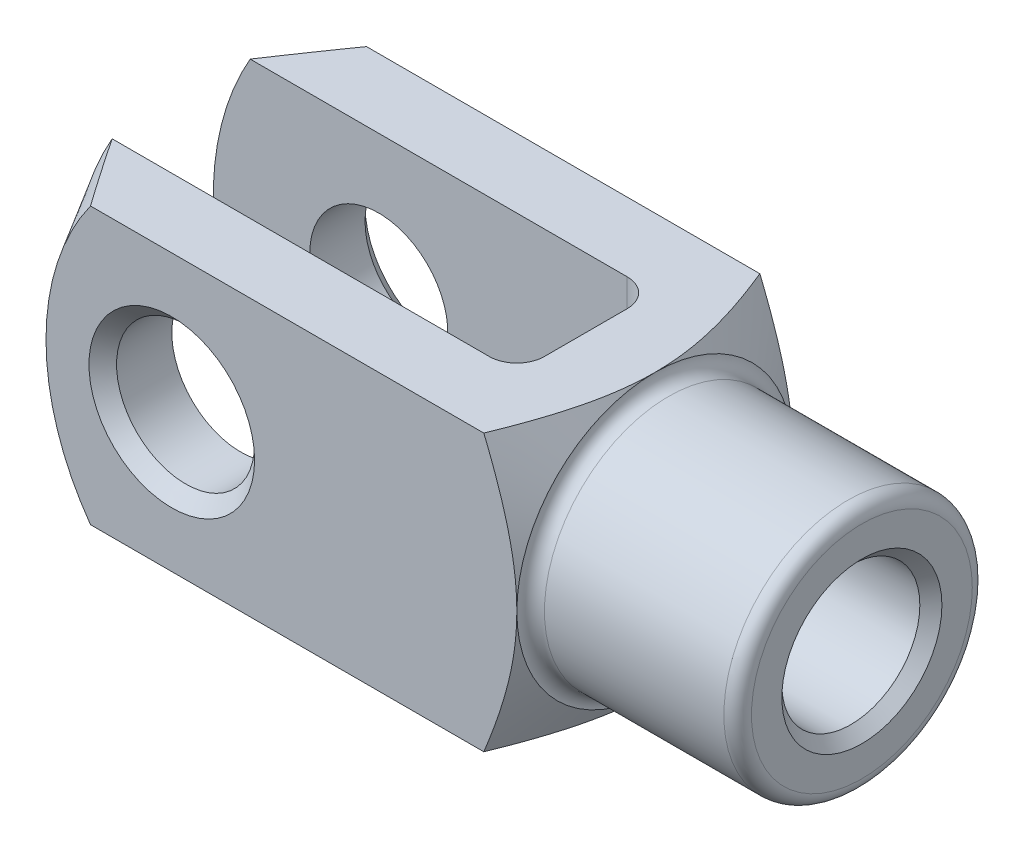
ISO-10303-21;
HEADER;
FILE_DESCRIPTION(('STEP AP214'),'2;1');
FILE_NAME('part.step','',(''),(''),'','','');
FILE_SCHEMA(('AUTOMOTIVE_DESIGN { 1 0 10303 214 1 1 1 1 }'));
ENDSEC;
DATA;
#1=APPLICATION_CONTEXT('core data for automotive mechanical design processes');
#2=APPLICATION_PROTOCOL_DEFINITION('international standard','automotive_design',2000,#1);
#3=PRODUCT_CONTEXT('',#1,'mechanical');
#4=PRODUCT('Part','Part','',(#3));
#5=PRODUCT_RELATED_PRODUCT_CATEGORY('part','',(#4));
#6=PRODUCT_DEFINITION_FORMATION('','',#4);
#7=PRODUCT_DEFINITION_CONTEXT('part definition',#1,'design');
#8=PRODUCT_DEFINITION('design','',#6,#7);
#9=PRODUCT_DEFINITION_SHAPE('','',#8);
#10=(LENGTH_UNIT() NAMED_UNIT(*) SI_UNIT(.MILLI.,.METRE.));
#11=(NAMED_UNIT(*) PLANE_ANGLE_UNIT() SI_UNIT($,.RADIAN.));
#12=(NAMED_UNIT(*) SI_UNIT($,.STERADIAN.) SOLID_ANGLE_UNIT());
#13=UNCERTAINTY_MEASURE_WITH_UNIT(LENGTH_MEASURE(1.E-05),#10,'distance_accuracy_value','');
#14=(GEOMETRIC_REPRESENTATION_CONTEXT(3) GLOBAL_UNCERTAINTY_ASSIGNED_CONTEXT((#13)) GLOBAL_UNIT_ASSIGNED_CONTEXT((#10,
#11,#12)) REPRESENTATION_CONTEXT('',''));
#15=CARTESIAN_POINT('',(0.,0.,0.));
#16=DIRECTION('',(0.,0.,1.));
#17=DIRECTION('',(1.,0.,0.));
#18=AXIS2_PLACEMENT_3D('',#15,#16,#17);
#19=CARTESIAN_POINT('',(-11.,-5.,-1.5));
#20=DIRECTION('',(0.,-1.,0.));
#21=DIRECTION('',(0.,0.,-1.));
#22=AXIS2_PLACEMENT_3D('',#19,#20,#21);
#23=CYLINDRICAL_SURFACE('',#22,1.);
#24=DIRECTION('',(0.,1.,0.));
#25=VECTOR('',#24,1.);
#26=CARTESIAN_POINT('',(-10.,-5.,-1.5));
#27=LINE('',#26,#25);
#28=CARTESIAN_POINT('',(-10.,-2.,-1.5));
#29=VERTEX_POINT('',#28);
#30=CARTESIAN_POINT('',(-10.,-5.,-1.5));
#31=VERTEX_POINT('',#30);
#32=EDGE_CURVE('E362',#29,#31,#27,.F.);
#33=ORIENTED_EDGE('',*,*,#32,.F.);
#34=CARTESIAN_POINT('',(-10.,-2.,-1.5));
#35=CARTESIAN_POINT('',(-10.0000040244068,-1.974348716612,-1.53421120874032));
#36=CARTESIAN_POINT('',(-10.0017545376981,-1.94783623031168,-1.56772297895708));
#37=CARTESIAN_POINT('',(-10.0083551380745,-1.89333893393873,-1.63311650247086));
#38=CARTESIAN_POINT('',(-10.0131998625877,-1.86535674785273,-1.66500097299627));
#39=CARTESIAN_POINT('',(-10.0316746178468,-1.78000865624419,-1.75742787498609));
#40=CARTESIAN_POINT('',(-10.0492612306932,-1.72072597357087,-1.81542638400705));
#41=CARTESIAN_POINT('',(-10.1015919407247,-1.57251315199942,-1.94699163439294));
#42=CARTESIAN_POINT('',(-10.1404500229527,-1.48167805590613,-2.01671959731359));
#43=CARTESIAN_POINT('',(-10.2290989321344,-1.29476697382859,-2.14156776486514));
#44=CARTESIAN_POINT('',(-10.2789555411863,-1.19866218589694,-2.19659547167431));
#45=CARTESIAN_POINT('',(-10.3701258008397,-1.03200593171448,-2.27834958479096));
#46=CARTESIAN_POINT('',(-10.4096778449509,-0.962194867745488,-2.30864712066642));
#47=CARTESIAN_POINT('',(-10.4913965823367,-0.821458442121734,-2.36238926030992));
#48=CARTESIAN_POINT('',(-10.5335644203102,-0.75053260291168,-2.38583083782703));
#49=CARTESIAN_POINT('',(-10.6625948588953,-0.536940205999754,-2.44613120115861));
#50=CARTESIAN_POINT('',(-10.7522192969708,-0.393043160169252,-2.4731643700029));
#51=CARTESIAN_POINT('',(-10.8932818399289,-0.168755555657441,-2.49559347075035));
#52=CARTESIAN_POINT('',(-10.9439640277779,-0.0886013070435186,-2.49971490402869));
#53=CARTESIAN_POINT('',(-10.99643651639,-0.00563435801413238,-2.49999523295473));
#54=CARTESIAN_POINT('',(-10.9982182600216,-0.00281717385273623,-2.49999999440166));
#55=CARTESIAN_POINT('',(-11.,0.,-2.5));
#56=B_SPLINE_CURVE_WITH_KNOTS('',3,(#34,#35,#36,#37,#38,#39,#40,#41,#42,#43,#44,#45,#46,#47,#48,
#49,#50,#51,#52,#53,#54,#55),.UNSPECIFIED.,.F.,.F.,(4,2,2,2,2,2,2,2,2,2,4),(0.,
0.128161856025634,0.256102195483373,0.509450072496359,0.870315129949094,1.23340004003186,
1.49037285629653,1.74745893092,2.26009785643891,2.54460067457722,2.55460068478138),.UNSPECIFIED.);
#57=CARTESIAN_POINT('',(-11.,0.,-2.5));
#58=VERTEX_POINT('',#57);
#59=EDGE_CURVE('E394',#29,#58,#56,.T.);
#60=ORIENTED_EDGE('',*,*,#59,.T.);
#61=DIRECTION('',(0.,1.,0.));
#62=VECTOR('',#61,1.);
#63=CARTESIAN_POINT('',(-11.,5.,-2.5));
#64=LINE('',#63,#62);
#65=CARTESIAN_POINT('',(-11.,-5.,-2.5));
#66=VERTEX_POINT('',#65);
#67=EDGE_CURVE('E183',#66,#58,#64,.T.);
#68=ORIENTED_EDGE('',*,*,#67,.F.);
#69=CARTESIAN_POINT('',(-11.,-5.,-1.5));
#70=DIRECTION('',(0.,-1.,0.));
#71=DIRECTION('',(0.,0.,-1.));
#72=AXIS2_PLACEMENT_3D('',#69,#70,#71);
#73=CIRCLE('',#72,1.);
#74=EDGE_CURVE('E198',#31,#66,#73,.F.);
#75=ORIENTED_EDGE('',*,*,#74,.F.);
#76=EDGE_LOOP('',(#33,#60,#68,#75));
#77=FACE_BOUND('',#76,.T.);
#78=ADVANCED_FACE('F37',(#77),#23,.F.);
#79=CARTESIAN_POINT('',(-10.,-5.,-2.5));
#80=DIRECTION('',(1.,0.,0.));
#81=DIRECTION('',(0.,0.,-1.));
#82=AXIS2_PLACEMENT_3D('',#79,#80,#81);
#83=PLANE('',#82);
#84=CARTESIAN_POINT('',(-10.,5.,-1.5));
#85=VERTEX_POINT('',#84);
#86=CARTESIAN_POINT('',(-10.,2.,-1.5));
#87=VERTEX_POINT('',#86);
#88=EDGE_CURVE('E378',#85,#87,#27,.F.);
#89=ORIENTED_EDGE('',*,*,#88,.T.);
#90=CARTESIAN_POINT('',(-10.,0.,0.));
#91=DIRECTION('',(1.,0.,0.));
#92=DIRECTION('',(0.,0.,-1.));
#93=AXIS2_PLACEMENT_3D('',#90,#91,#92);
#94=CIRCLE('',#93,2.5);
#95=CARTESIAN_POINT('',(-10.,2.,1.5));
#96=VERTEX_POINT('',#95);
#97=EDGE_CURVE('E415',#87,#96,#94,.T.);
#98=ORIENTED_EDGE('',*,*,#97,.T.);
#99=DIRECTION('',(0.,1.,0.));
#100=VECTOR('',#99,1.);
#101=CARTESIAN_POINT('',(-10.,5.,1.5));
#102=LINE('',#101,#100);
#103=CARTESIAN_POINT('',(-10.,5.,1.5));
#104=VERTEX_POINT('',#103);
#105=EDGE_CURVE('E160',#96,#104,#102,.T.);
#106=ORIENTED_EDGE('',*,*,#105,.T.);
#107=DIRECTION('',(0.,0.,-1.));
#108=VECTOR('',#107,1.);
#109=CARTESIAN_POINT('',(-10.,5.,-2.5));
#110=LINE('',#109,#108);
#111=EDGE_CURVE('E342',#104,#85,#110,.T.);
#112=ORIENTED_EDGE('',*,*,#111,.T.);
#113=EDGE_LOOP('',(#89,#98,#106,#112));
#114=FACE_BOUND('',#113,.T.);
#115=ADVANCED_FACE('F454',(#114),#83,.F.);
#116=CARTESIAN_POINT('',(-11.,-5.,1.5));
#117=DIRECTION('',(0.,-1.,0.));
#118=DIRECTION('',(0.,0.,-1.));
#119=AXIS2_PLACEMENT_3D('',#116,#117,#118);
#120=CYLINDRICAL_SURFACE('',#119,1.);
#121=ORIENTED_EDGE('',*,*,#105,.F.);
#122=CARTESIAN_POINT('',(-10.,2.,1.5));
#123=CARTESIAN_POINT('',(-10.0000040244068,1.97434871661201,1.53421120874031));
#124=CARTESIAN_POINT('',(-10.0017545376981,1.9478362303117,1.56772297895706));
#125=CARTESIAN_POINT('',(-10.0083551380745,1.89333893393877,1.63311650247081));
#126=CARTESIAN_POINT('',(-10.0131998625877,1.86535674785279,1.66500097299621));
#127=CARTESIAN_POINT('',(-10.0316746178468,1.78000865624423,1.75742787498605));
#128=CARTESIAN_POINT('',(-10.0492612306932,1.72072597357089,1.81542638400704));
#129=CARTESIAN_POINT('',(-10.1015919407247,1.5725131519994,1.94699163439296));
#130=CARTESIAN_POINT('',(-10.1404500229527,1.48167805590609,2.01671959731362));
#131=CARTESIAN_POINT('',(-10.2290989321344,1.29476697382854,2.14156776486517));
#132=CARTESIAN_POINT('',(-10.2789555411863,1.19866218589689,2.19659547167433));
#133=CARTESIAN_POINT('',(-10.3701258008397,1.0320059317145,2.27834958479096));
#134=CARTESIAN_POINT('',(-10.409677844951,0.962194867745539,2.30864712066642));
#135=CARTESIAN_POINT('',(-10.4913965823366,0.821458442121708,2.36238926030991));
#136=CARTESIAN_POINT('',(-10.5335644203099,0.750532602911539,2.38583083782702));
#137=CARTESIAN_POINT('',(-10.6625948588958,0.53694020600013,2.44613120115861));
#138=CARTESIAN_POINT('',(-10.7522192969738,0.393043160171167,2.47316437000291));
#139=CARTESIAN_POINT('',(-10.8932818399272,0.168755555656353,2.49559347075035));
#140=CARTESIAN_POINT('',(-10.9439640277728,0.0886013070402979,2.49971490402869));
#141=CARTESIAN_POINT('',(-10.9964365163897,0.00563435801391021,2.49999523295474));
#142=CARTESIAN_POINT('',(-10.9982182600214,0.00281717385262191,2.49999999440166));
#143=CARTESIAN_POINT('',(-11.,0.,2.5));
#144=B_SPLINE_CURVE_WITH_KNOTS('',3,(#122,#123,#124,#125,#126,#127,#128,#129,#130,#131,#132,
#133,#134,#135,#136,#137,#138,#139,#140,#141,#142,#143),.UNSPECIFIED.,.F.,.F.,(4,2,2,2,2,2,2,2,
2,2,4),(0.,0.128161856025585,0.256102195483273,0.509450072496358,0.870315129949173,
1.23340004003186,1.49037285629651,1.74745893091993,2.26009785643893,2.54460067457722,
2.55460068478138),.UNSPECIFIED.);
#145=CARTESIAN_POINT('',(-11.,0.,2.5));
#146=VERTEX_POINT('',#145);
#147=EDGE_CURVE('E145',#96,#146,#144,.T.);
#148=ORIENTED_EDGE('',*,*,#147,.T.);
#149=DIRECTION('',(0.,1.,0.));
#150=VECTOR('',#149,1.);
#151=CARTESIAN_POINT('',(-11.,-5.,2.5));
#152=LINE('',#151,#150);
#153=CARTESIAN_POINT('',(-11.,5.,2.5));
#154=VERTEX_POINT('',#153);
#155=EDGE_CURVE('E159',#154,#146,#152,.F.);
#156=ORIENTED_EDGE('',*,*,#155,.F.);
#157=CARTESIAN_POINT('',(-11.,5.,1.5));
#158=DIRECTION('',(0.,1.,0.));
#159=DIRECTION('',(0.,0.,1.));
#160=AXIS2_PLACEMENT_3D('',#157,#158,#159);
#161=CIRCLE('',#160,1.);
#162=EDGE_CURVE('E190',#104,#154,#161,.F.);
#163=ORIENTED_EDGE('',*,*,#162,.F.);
#164=EDGE_LOOP('',(#121,#148,#156,#163));
#165=FACE_BOUND('',#164,.T.);
#166=ADVANCED_FACE('F156',(#165),#120,.F.);
#167=CARTESIAN_POINT('',(-26.,-5.,-2.5));
#168=DIRECTION('',(0.,0.,-1.));
#169=DIRECTION('',(-1.,0.,0.));
#170=AXIS2_PLACEMENT_3D('',#167,#168,#169);
#171=PLANE('',#170);
#172=CARTESIAN_POINT('',(-20.,0.,-2.5));
#173=DIRECTION('',(0.,0.,-1.));
#174=DIRECTION('',(-1.,0.,0.));
#175=AXIS2_PLACEMENT_3D('',#172,#173,#174);
#176=CIRCLE('',#175,2.5);
#177=CARTESIAN_POINT('',(-22.5,0.,-2.5));
#178=VERTEX_POINT('',#177);
#179=EDGE_CURVE('E372',#178,#178,#176,.F.);
#180=ORIENTED_EDGE('',*,*,#179,.F.);
#181=EDGE_LOOP('',(#180));
#182=FACE_BOUND('',#181,.T.);
#183=CARTESIAN_POINT('',(-16.,0.,-2.5));
#184=DIRECTION('',(0.,0.,1.));
#185=DIRECTION('',(1.,0.,0.));
#186=AXIS2_PLACEMENT_3D('',#183,#184,#185);
#187=CIRCLE('',#186,10.);
#188=CARTESIAN_POINT('',(-24.6602540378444,5.,-2.5));
#189=VERTEX_POINT('',#188);
#190=CARTESIAN_POINT('',(-24.6602540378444,-5.,-2.5));
#191=VERTEX_POINT('',#190);
#192=EDGE_CURVE('E282',#189,#191,#187,.T.);
#193=ORIENTED_EDGE('',*,*,#192,.T.);
#194=DIRECTION('',(-1.,0.,0.));
#195=VECTOR('',#194,1.);
#196=CARTESIAN_POINT('',(-26.,-5.,-2.5));
#197=LINE('',#196,#195);
#198=EDGE_CURVE('E338',#66,#191,#197,.T.);
#199=ORIENTED_EDGE('',*,*,#198,.F.);
#200=ORIENTED_EDGE('',*,*,#67,.T.);
#201=CARTESIAN_POINT('',(-11.,5.,-2.5));
#202=VERTEX_POINT('',#201);
#203=EDGE_CURVE('E179',#58,#202,#64,.T.);
#204=ORIENTED_EDGE('',*,*,#203,.T.);
#205=DIRECTION('',(-1.,0.,0.));
#206=VECTOR('',#205,1.);
#207=CARTESIAN_POINT('',(-26.,5.,-2.5));
#208=LINE('',#207,#206);
#209=EDGE_CURVE('E350',#202,#189,#208,.T.);
#210=ORIENTED_EDGE('',*,*,#209,.T.);
#211=EDGE_LOOP('',(#193,#199,#200,#204,#210));
#212=FACE_BOUND('',#211,.T.);
#213=ADVANCED_FACE('F397',(#182,#212),#171,.F.);
#214=CARTESIAN_POINT('',(-26.,-5.,2.5));
#215=DIRECTION('',(0.,0.,1.));
#216=DIRECTION('',(1.,0.,0.));
#217=AXIS2_PLACEMENT_3D('',#214,#215,#216);
#218=PLANE('',#217);
#219=CARTESIAN_POINT('',(-20.,0.,2.5));
#220=DIRECTION('',(0.,0.,1.));
#221=DIRECTION('',(1.,0.,0.));
#222=AXIS2_PLACEMENT_3D('',#219,#220,#221);
#223=CIRCLE('',#222,2.5);
#224=CARTESIAN_POINT('',(-17.5,0.,2.5));
#225=VERTEX_POINT('',#224);
#226=EDGE_CURVE('E349',#225,#225,#223,.F.);
#227=ORIENTED_EDGE('',*,*,#226,.F.);
#228=EDGE_LOOP('',(#227));
#229=FACE_BOUND('',#228,.T.);
#230=DIRECTION('',(1.,0.,0.));
#231=VECTOR('',#230,1.);
#232=CARTESIAN_POINT('',(-26.,-5.,2.5));
#233=LINE('',#232,#231);
#234=CARTESIAN_POINT('',(-24.6602540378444,-5.,2.5));
#235=VERTEX_POINT('',#234);
#236=CARTESIAN_POINT('',(-11.,-5.,2.5));
#237=VERTEX_POINT('',#236);
#238=EDGE_CURVE('E341',#235,#237,#233,.T.);
#239=ORIENTED_EDGE('',*,*,#238,.F.);
#240=CARTESIAN_POINT('',(-16.,0.,2.5));
#241=DIRECTION('',(0.,0.,1.));
#242=DIRECTION('',(1.,0.,0.));
#243=AXIS2_PLACEMENT_3D('',#240,#241,#242);
#244=CIRCLE('',#243,10.);
#245=CARTESIAN_POINT('',(-24.6602540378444,5.,2.5));
#246=VERTEX_POINT('',#245);
#247=EDGE_CURVE('E425',#246,#235,#244,.T.);
#248=ORIENTED_EDGE('',*,*,#247,.F.);
#249=DIRECTION('',(1.,0.,0.));
#250=VECTOR('',#249,1.);
#251=CARTESIAN_POINT('',(-26.,5.,2.5));
#252=LINE('',#251,#250);
#253=EDGE_CURVE('E176',#246,#154,#252,.T.);
#254=ORIENTED_EDGE('',*,*,#253,.T.);
#255=ORIENTED_EDGE('',*,*,#155,.T.);
#256=EDGE_CURVE('E164',#146,#237,#152,.F.);
#257=ORIENTED_EDGE('',*,*,#256,.T.);
#258=EDGE_LOOP('',(#239,#248,#254,#255,#257));
#259=FACE_BOUND('',#258,.T.);
#260=ADVANCED_FACE('F173',(#229,#259),#218,.F.);
#261=CARTESIAN_POINT('',(-26.,-5.,5.));
#262=DIRECTION('',(0.,0.,1.));
#263=DIRECTION('',(1.,0.,0.));
#264=AXIS2_PLACEMENT_3D('',#261,#262,#263);
#265=PLANE('',#264);
#266=CARTESIAN_POINT('',(-20.,0.,5.));
#267=DIRECTION('',(0.,0.,1.));
#268=DIRECTION('',(1.,0.,0.));
#269=AXIS2_PLACEMENT_3D('',#266,#267,#268);
#270=CIRCLE('',#269,3.00000000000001);
#271=CARTESIAN_POINT('',(-17.,0.,5.));
#272=VERTEX_POINT('',#271);
#273=EDGE_CURVE('E240',#272,#272,#270,.F.);
#274=ORIENTED_EDGE('',*,*,#273,.T.);
#275=EDGE_LOOP('',(#274));
#276=FACE_BOUND('',#275,.T.);
#277=DIRECTION('',(1.,0.,0.));
#278=VECTOR('',#277,1.);
#279=CARTESIAN_POINT('',(-26.,5.,5.));
#280=LINE('',#279,#278);
#281=CARTESIAN_POINT('',(-22.9437612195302,5.,5.));
#282=VERTEX_POINT('',#281);
#283=CARTESIAN_POINT('',(-8.69573155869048,5.,5.));
#284=VERTEX_POINT('',#283);
#285=EDGE_CURVE('E369',#282,#284,#280,.T.);
#286=ORIENTED_EDGE('',*,*,#285,.F.);
#287=CARTESIAN_POINT('',(-16.,0.,5.));
#288=DIRECTION('',(0.,0.,1.));
#289=DIRECTION('',(1.,0.,0.));
#290=AXIS2_PLACEMENT_3D('',#287,#288,#289);
#291=CIRCLE('',#290,8.55662432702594);
#292=CARTESIAN_POINT('',(-22.9437612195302,-5.,5.));
#293=VERTEX_POINT('',#292);
#294=EDGE_CURVE('E61',#282,#293,#291,.T.);
#295=ORIENTED_EDGE('',*,*,#294,.T.);
#296=DIRECTION('',(1.,0.,0.));
#297=VECTOR('',#296,1.);
#298=CARTESIAN_POINT('',(-26.,-5.,5.));
#299=LINE('',#298,#297);
#300=CARTESIAN_POINT('',(-8.69573155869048,-5.,5.));
#301=VERTEX_POINT('',#300);
#302=EDGE_CURVE('E366',#293,#301,#299,.T.);
#303=ORIENTED_EDGE('',*,*,#302,.T.);
#304=CARTESIAN_POINT('',(-11.1779367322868,-10.2120217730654,5.));
#305=CARTESIAN_POINT('',(-11.0501732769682,-9.9655918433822,5.));
#306=CARTESIAN_POINT('',(-10.9230852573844,-9.71880849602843,5.));
#307=CARTESIAN_POINT('',(-10.6706182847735,-9.22435307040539,5.));
#308=CARTESIAN_POINT('',(-10.5452394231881,-8.97668094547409,5.));
#309=CARTESIAN_POINT('',(-10.2963461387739,-8.47986010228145,5.));
#310=CARTESIAN_POINT('',(-10.1728353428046,-8.23070956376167,5.));
#311=CARTESIAN_POINT('',(-9.92841321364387,-7.73114008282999,5.));
#312=CARTESIAN_POINT('',(-9.80750183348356,-7.48072116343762,5.));
#313=CARTESIAN_POINT('',(-9.56160218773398,-6.96287579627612,5.));
#314=CARTESIAN_POINT('',(-9.43682075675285,-6.69535084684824,5.));
#315=CARTESIAN_POINT('',(-9.19200723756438,-6.15811043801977,5.));
#316=CARTESIAN_POINT('',(-9.07197539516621,-5.88839486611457,5.));
#317=CARTESIAN_POINT('',(-8.8382236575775,-5.34637384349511,5.));
#318=CARTESIAN_POINT('',(-8.72450095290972,-5.07406960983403,5.));
#319=CARTESIAN_POINT('',(-8.50540502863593,-4.5261205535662,5.));
#320=CARTESIAN_POINT('',(-8.40003081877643,-4.25047613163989,5.));
#321=CARTESIAN_POINT('',(-8.23962651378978,-3.80384985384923,5.));
#322=CARTESIAN_POINT('',(-8.18103937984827,-3.63414725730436,5.));
#323=CARTESIAN_POINT('',(-8.06890917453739,-3.2930890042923,5.));
#324=CARTESIAN_POINT('',(-8.01536567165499,-3.12173349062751,5.));
#325=CARTESIAN_POINT('',(-7.91431435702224,-2.77724742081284,5.));
#326=CARTESIAN_POINT('',(-7.86680629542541,-2.60411693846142,5.));
#327=CARTESIAN_POINT('',(-7.77895823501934,-2.2560245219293,5.));
#328=CARTESIAN_POINT('',(-7.73861845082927,-2.08106253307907,5.));
#329=CARTESIAN_POINT('',(-7.66717141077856,-1.73351278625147,5.));
#330=CARTESIAN_POINT('',(-7.63587016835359,-1.56096530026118,5.));
#331=CARTESIAN_POINT('',(-7.58237487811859,-1.21448473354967,5.));
#332=CARTESIAN_POINT('',(-7.56017887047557,-1.04055195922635,5.));
#333=CARTESIAN_POINT('',(-7.52581186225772,-0.691784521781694,5.));
#334=CARTESIAN_POINT('',(-7.5136352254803,-0.516950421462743,5.));
#335=CARTESIAN_POINT('',(-7.49984755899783,-0.166864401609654,5.));
#336=CARTESIAN_POINT('',(-7.49823615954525,0.00838750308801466,5.));
#337=CARTESIAN_POINT('',(-7.50538143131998,0.345895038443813,5.));
#338=CARTESIAN_POINT('',(-7.51339117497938,0.508167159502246,5.));
#339=CARTESIAN_POINT('',(-7.5382276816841,0.83202803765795,5.));
#340=CARTESIAN_POINT('',(-7.55505442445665,0.993616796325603,5.));
#341=CARTESIAN_POINT('',(-7.59690806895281,1.31580153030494,5.));
#342=CARTESIAN_POINT('',(-7.62193920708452,1.47639694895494,5.));
#343=CARTESIAN_POINT('',(-7.67937635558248,1.79625495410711,5.));
#344=CARTESIAN_POINT('',(-7.71178257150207,1.95551750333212,5.));
#345=CARTESIAN_POINT('',(-7.78410006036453,2.27716431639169,5.));
#346=CARTESIAN_POINT('',(-7.82420141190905,2.43950551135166,5.));
#347=CARTESIAN_POINT('',(-7.91029090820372,2.76260917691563,5.));
#348=CARTESIAN_POINT('',(-7.95627910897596,2.9233716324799,5.));
#349=CARTESIAN_POINT('',(-8.05325217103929,3.24336572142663,5.));
#350=CARTESIAN_POINT('',(-8.10423680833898,3.40259742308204,5.));
#351=CARTESIAN_POINT('',(-8.21042325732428,3.71963213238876,5.));
#352=CARTESIAN_POINT('',(-8.26562484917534,3.87743521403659,5.));
#353=CARTESIAN_POINT('',(-8.38422548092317,4.20455781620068,5.));
#354=CARTESIAN_POINT('',(-8.44792594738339,4.37376771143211,5.));
#355=CARTESIAN_POINT('',(-8.57878961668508,4.71084645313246,5.));
#356=CARTESIAN_POINT('',(-8.64595298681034,4.87871523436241,5.));
#357=CARTESIAN_POINT('',(-8.85177672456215,5.38062019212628,5.));
#358=CARTESIAN_POINT('',(-8.99474620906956,5.71288883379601,5.));
#359=CARTESIAN_POINT('',(-9.28888284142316,6.37408373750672,5.));
#360=CARTESIAN_POINT('',(-9.44005700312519,6.70300684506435,5.));
#361=CARTESIAN_POINT('',(-9.7482557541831,7.35804934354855,5.));
#362=CARTESIAN_POINT('',(-9.90527972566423,7.68416902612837,5.));
#363=CARTESIAN_POINT('',(-10.2241567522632,8.33526441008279,5.));
#364=CARTESIAN_POINT('',(-10.3860230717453,8.66023359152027,5.));
#365=CARTESIAN_POINT('',(-10.7130699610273,9.30850558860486,5.));
#366=CARTESIAN_POINT('',(-10.8782506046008,9.6318083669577,5.));
#367=CARTESIAN_POINT('',(-11.2110861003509,10.2769312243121,5.));
#368=CARTESIAN_POINT('',(-11.3787396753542,10.5987519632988,5.));
#369=CARTESIAN_POINT('',(-11.716060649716,11.2413369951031,5.));
#370=CARTESIAN_POINT('',(-11.8857280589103,11.5621012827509,5.));
#371=CARTESIAN_POINT('',(-12.3464966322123,12.427966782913,5.));
#372=CARTESIAN_POINT('',(-12.6391179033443,12.9722587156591,5.));
#373=CARTESIAN_POINT('',(-13.2276625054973,14.0591501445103,5.));
#374=CARTESIAN_POINT('',(-13.5235862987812,14.6017493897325,5.));
#375=CARTESIAN_POINT('',(-14.1161130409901,15.6825374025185,5.));
#376=CARTESIAN_POINT('',(-14.4127023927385,16.2207336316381,5.));
#377=CARTESIAN_POINT('',(-15.0076407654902,17.296041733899,5.));
#378=CARTESIAN_POINT('',(-15.3059895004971,17.8331537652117,5.));
#379=CARTESIAN_POINT('',(-15.6049680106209,18.3699124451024,5.));
#380=B_SPLINE_CURVE_WITH_KNOTS('',3,(#304,#305,#306,#307,#308,#309,#310,#311,#312,#313,#314,
#315,#316,#317,#318,#319,#320,#321,#322,#323,#324,#325,#326,#327,#328,#329,#330,#331,#332,#333,
#334,#335,#336,#337,#338,#339,#340,#341,#342,#343,#344,#345,#346,#347,#348,#349,#350,#351,#352,
#353,#354,#355,#356,#357,#358,#359,#360,#361,#362,#363,#364,#365,#366,#367,#368,#369,#370,#371,
#372,#373,#374,#375,#376,#377,#378,#379),.UNSPECIFIED.,.F.,.F.,(4,2,2,2,2,2,2,2,2,2,2,2,2,2,2,2,
2,2,2,2,2,2,2,2,2,2,2,2,2,2,2,2,2,2,2,2,2,4),(0.,0.832746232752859,1.66553684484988,
2.49977764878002,3.33400336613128,4.21955297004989,5.10514834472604,5.99034614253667,
6.87543878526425,7.41396978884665,7.95245467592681,8.49091726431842,9.02939597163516,
9.55527179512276,10.0810343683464,10.606500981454,11.1319492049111,11.6191099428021,
12.1062695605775,12.5936811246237,13.081106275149,13.5826395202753,14.0841775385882,
14.5856930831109,15.0871825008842,15.6295449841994,16.1719336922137,17.2569226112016,
18.3428541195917,19.4286712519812,20.5177991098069,21.6069512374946,22.6955592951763,
23.78417267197,25.6380502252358,27.4921906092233,29.3357115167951,31.1789405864),.UNSPECIFIED.);
#381=CARTESIAN_POINT('',(-7.5,0.,5.));
#382=VERTEX_POINT('',#381);
#383=EDGE_CURVE('E310',#382,#301,#380,.F.);
#384=ORIENTED_EDGE('',*,*,#383,.F.);
#385=EDGE_CURVE('E308',#284,#382,#380,.F.);
#386=ORIENTED_EDGE('',*,*,#385,.F.);
#387=EDGE_LOOP('',(#286,#295,#303,#384,#386));
#388=FACE_BOUND('',#387,.T.);
#389=ADVANCED_FACE('F293',(#276,#388),#265,.T.);
#390=CARTESIAN_POINT('',(-26.,-5.,5.));
#391=DIRECTION('',(0.,-1.,0.));
#392=DIRECTION('',(0.,0.,-1.));
#393=AXIS2_PLACEMENT_3D('',#390,#391,#392);
#394=PLANE('',#393);
#395=ORIENTED_EDGE('',*,*,#198,.T.);
#396=CARTESIAN_POINT('',(-28.6161570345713,-5.,3.68485843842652));
#397=CARTESIAN_POINT('',(-28.3728735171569,-5.,3.29314977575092));
#398=CARTESIAN_POINT('',(-28.1289237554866,-5.,2.90185301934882));
#399=CARTESIAN_POINT('',(-27.6393799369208,-5.,2.12027873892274));
#400=CARTESIAN_POINT('',(-27.3937858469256,-5.,1.73000123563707));
#401=CARTESIAN_POINT('',(-26.9003569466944,-5.,0.950211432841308));
#402=CARTESIAN_POINT('',(-26.6525198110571,-5.,0.560700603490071));
#403=CARTESIAN_POINT('',(-26.1544780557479,-5.,-0.216801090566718));
#404=CARTESIAN_POINT('',(-25.9042734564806,-5.,-0.604791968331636));
#405=CARTESIAN_POINT('',(-25.3904709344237,-5.,-1.39500462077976));
#406=CARTESIAN_POINT('',(-25.1267492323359,-5.,-1.79714601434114));
#407=CARTESIAN_POINT('',(-24.5953246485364,-5.,-2.59878951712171));
#408=CARTESIAN_POINT('',(-24.3276218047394,-5.,-2.99829165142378));
#409=CARTESIAN_POINT('',(-23.7872819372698,-5.,-3.79351799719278));
#410=CARTESIAN_POINT('',(-23.5146487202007,-5.,-4.18924479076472));
#411=CARTESIAN_POINT('',(-22.9626344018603,-5.,-4.9759583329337));
#412=CARTESIAN_POINT('',(-22.6832536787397,-5.,-5.36694534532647));
#413=CARTESIAN_POINT('',(-22.2585707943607,-5.,-5.9465458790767));
#414=CARTESIAN_POINT('',(-22.1167558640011,-5.,-6.13771436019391));
#415=CARTESIAN_POINT('',(-21.8304276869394,-5.,-6.51801720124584));
#416=CARTESIAN_POINT('',(-21.6859145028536,-5.,-6.70715160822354));
#417=CARTESIAN_POINT('',(-21.3934623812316,-5.,-7.08318222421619));
#418=CARTESIAN_POINT('',(-21.2455189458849,-5.,-7.27007494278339));
#419=CARTESIAN_POINT('',(-20.9457328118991,-5.,-7.64069985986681));
#420=CARTESIAN_POINT('',(-20.7938903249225,-5.,-7.82443222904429));
#421=CARTESIAN_POINT('',(-20.4870234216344,-5.,-8.18596657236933));
#422=CARTESIAN_POINT('',(-20.3320483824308,-5.,-8.36381030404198));
#423=CARTESIAN_POINT('',(-20.016256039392,-5.,-8.71434786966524));
#424=CARTESIAN_POINT('',(-19.8554372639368,-5.,-8.8870403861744));
#425=CARTESIAN_POINT('',(-19.526893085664,-5.,-9.22500913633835));
#426=CARTESIAN_POINT('',(-19.359184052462,-5.,-9.39030119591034));
#427=CARTESIAN_POINT('',(-19.0146658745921,-5.,-9.71104872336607));
#428=CARTESIAN_POINT('',(-18.8378629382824,-5.,-9.86651074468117));
#429=CARTESIAN_POINT('',(-18.5607263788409,-5.,-10.0916231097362));
#430=CARTESIAN_POINT('',(-18.4646388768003,-5.,-10.166497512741));
#431=CARTESIAN_POINT('',(-18.2689237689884,-5.,-10.3115375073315));
#432=CARTESIAN_POINT('',(-18.1692954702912,-5.,-10.3817021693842));
#433=CARTESIAN_POINT('',(-17.966203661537,-5.,-10.5161269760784));
#434=CARTESIAN_POINT('',(-17.8627432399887,-5.,-10.5803917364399));
#435=CARTESIAN_POINT('',(-17.6516728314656,-5.,-10.7016113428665));
#436=CARTESIAN_POINT('',(-17.5440639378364,-5.,-10.7585680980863));
#437=CARTESIAN_POINT('',(-17.2646742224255,-5.,-10.8919682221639));
#438=CARTESIAN_POINT('',(-17.0897644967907,-5.,-10.9622087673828));
#439=CARTESIAN_POINT('',(-16.8207698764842,-5.,-11.0456804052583));
#440=CARTESIAN_POINT('',(-16.7300249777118,-5.,-11.0698525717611));
#441=CARTESIAN_POINT('',(-16.5467659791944,-5.,-11.1100471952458));
#442=CARTESIAN_POINT('',(-16.4542528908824,-5.,-11.1260741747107));
#443=CARTESIAN_POINT('',(-16.2671601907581,-5.,-11.1494213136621));
#444=CARTESIAN_POINT('',(-16.172569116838,-5.,-11.1566505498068));
#445=CARTESIAN_POINT('',(-15.9831348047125,-5.,-11.1617580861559));
#446=CARTESIAN_POINT('',(-15.8882915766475,-5.,-11.1596367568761));
#447=CARTESIAN_POINT('',(-15.6992539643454,-5.,-11.1461448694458));
#448=CARTESIAN_POINT('',(-15.6050597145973,-5.,-11.1347724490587));
#449=CARTESIAN_POINT('',(-15.4181469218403,-5.,-11.1033021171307));
#450=CARTESIAN_POINT('',(-15.3254286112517,-5.,-11.0832028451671));
#451=CARTESIAN_POINT('',(-15.1250906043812,-5.,-11.0306393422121));
#452=CARTESIAN_POINT('',(-15.0178926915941,-5.,-10.9965741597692));
#453=CARTESIAN_POINT('',(-14.8069839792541,-5.,-10.9189382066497));
#454=CARTESIAN_POINT('',(-14.7032751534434,-5.,-10.8753621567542));
#455=CARTESIAN_POINT('',(-14.4992757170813,-5.,-10.7801830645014));
#456=CARTESIAN_POINT('',(-14.3989959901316,-5.,-10.728556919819));
#457=CARTESIAN_POINT('',(-14.2021050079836,-5.,-10.6188116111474));
#458=CARTESIAN_POINT('',(-14.1054933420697,-5.,-10.5606931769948));
#459=CARTESIAN_POINT('',(-13.8845388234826,-5.,-10.4192139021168));
#460=CARTESIAN_POINT('',(-13.7614975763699,-5.,-10.3338274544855));
#461=CARTESIAN_POINT('',(-13.5206980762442,-5.,-10.1558693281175));
#462=CARTESIAN_POINT('',(-13.4029423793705,-5.,-10.063294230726));
#463=CARTESIAN_POINT('',(-13.1718232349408,-5.,-9.87240526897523));
#464=CARTESIAN_POINT('',(-13.0584686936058,-5.,-9.77408068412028));
#465=CARTESIAN_POINT('',(-12.8357596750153,-5.,-9.57306098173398));
#466=CARTESIAN_POINT('',(-12.726404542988,-5.,-9.47036658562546));
#467=CARTESIAN_POINT('',(-12.5103906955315,-5.,-9.26077594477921));
#468=CARTESIAN_POINT('',(-12.4037548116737,-5.,-9.15385625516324));
#469=CARTESIAN_POINT('',(-12.1934548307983,-5.,-8.93712706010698));
#470=CARTESIAN_POINT('',(-12.0897909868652,-5.,-8.82731731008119));
#471=CARTESIAN_POINT('',(-11.7828585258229,-5.,-8.49460182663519));
#472=CARTESIAN_POINT('',(-11.5834078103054,-5.,-8.26817141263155));
#473=CARTESIAN_POINT('',(-11.2495908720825,-5.,-7.87611763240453));
#474=CARTESIAN_POINT('',(-11.1132838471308,-5.,-7.71212538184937));
#475=CARTESIAN_POINT('',(-10.8438776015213,-5.,-7.38147097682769));
#476=CARTESIAN_POINT('',(-10.7107790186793,-5.,-7.21480830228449));
#477=CARTESIAN_POINT('',(-10.449318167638,-5.,-6.88192327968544));
#478=CARTESIAN_POINT('',(-10.3209145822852,-5.,-6.71573326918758));
#479=CARTESIAN_POINT('',(-10.0664074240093,-5.,-6.38167969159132));
#480=CARTESIAN_POINT('',(-9.94030316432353,-5.,-6.21381664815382));
#481=CARTESIAN_POINT('',(-9.81514156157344,-5.,-6.04526137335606));
#482=B_SPLINE_CURVE_WITH_KNOTS('',3,(#396,#397,#398,#399,#400,#401,#402,#403,#404,#405,#406,
#407,#408,#409,#410,#411,#412,#413,#414,#415,#416,#417,#418,#419,#420,#421,#422,#423,#424,#425,
#426,#427,#428,#429,#430,#431,#432,#433,#434,#435,#436,#437,#438,#439,#440,#441,#442,#443,#444,
#445,#446,#447,#448,#449,#450,#451,#452,#453,#454,#455,#456,#457,#458,#459,#460,#461,#462,#463,
#464,#465,#466,#467,#468,#469,#470,#471,#472,#473,#474,#475,#476,#477,#478,#479,#480,#481),
.UNSPECIFIED.,.F.,.F.,(4,2,2,2,2,2,2,2,2,2,2,2,2,2,2,2,2,2,2,2,2,2,2,2,2,2,2,2,2,2,2,2,2,2,2,2,
2,2,2,2,2,2,4),(0.,1.38333209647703,2.76669212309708,4.15170397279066,5.5367038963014,
6.97939224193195,8.42206685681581,9.86367153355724,11.3051956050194,12.0192581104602,
12.7333040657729,13.4483461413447,14.1633494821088,14.8709323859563,15.5786947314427,
16.2848631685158,16.9905557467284,17.3558886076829,17.7212933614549,18.0864097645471,
18.4514305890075,19.0145750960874,19.295997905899,19.5772642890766,19.8614134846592,
20.1455514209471,20.4297465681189,20.7139860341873,21.0508866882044,21.3879748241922,
21.7260487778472,22.0640847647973,22.5130303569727,22.962190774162,23.4122171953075,
23.862169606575,24.3151211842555,24.768111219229,25.6730749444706,26.3127741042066,
26.9525994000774,27.5826270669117,28.2124633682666),.UNSPECIFIED.);
#483=CARTESIAN_POINT('',(-22.9437612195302,-5.,-5.));
#484=VERTEX_POINT('',#483);
#485=EDGE_CURVE('E281',#191,#484,#482,.T.);
#486=ORIENTED_EDGE('',*,*,#485,.T.);
#487=DIRECTION('',(1.,0.,0.));
#488=VECTOR('',#487,1.);
#489=CARTESIAN_POINT('',(-26.,-5.,-5.));
#490=LINE('',#489,#488);
#491=CARTESIAN_POINT('',(-8.69573155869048,-5.,-5.));
#492=VERTEX_POINT('',#491);
#493=EDGE_CURVE('E363',#484,#492,#490,.T.);
#494=ORIENTED_EDGE('',*,*,#493,.T.);
#495=CARTESIAN_POINT('',(-11.1779367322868,-5.,-10.2120217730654));
#496=CARTESIAN_POINT('',(-11.0501732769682,-5.,-9.9655918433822));
#497=CARTESIAN_POINT('',(-10.9230852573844,-5.,-9.71880849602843));
#498=CARTESIAN_POINT('',(-10.6706182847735,-5.,-9.22435307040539));
#499=CARTESIAN_POINT('',(-10.5452394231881,-5.,-8.97668094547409));
#500=CARTESIAN_POINT('',(-10.2963461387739,-5.,-8.47986010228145));
#501=CARTESIAN_POINT('',(-10.1728353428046,-5.,-8.23070956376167));
#502=CARTESIAN_POINT('',(-9.92841321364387,-5.,-7.73114008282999));
#503=CARTESIAN_POINT('',(-9.80750183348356,-5.,-7.48072116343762));
#504=CARTESIAN_POINT('',(-9.56160218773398,-5.,-6.96287579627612));
#505=CARTESIAN_POINT('',(-9.43682075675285,-5.,-6.69535084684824));
#506=CARTESIAN_POINT('',(-9.19200723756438,-5.,-6.15811043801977));
#507=CARTESIAN_POINT('',(-9.07197539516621,-5.,-5.88839486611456));
#508=CARTESIAN_POINT('',(-8.8382236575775,-5.,-5.34637384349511));
#509=CARTESIAN_POINT('',(-8.72450095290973,-5.,-5.07406960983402));
#510=CARTESIAN_POINT('',(-8.50540502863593,-5.,-4.5261205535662));
#511=CARTESIAN_POINT('',(-8.40003081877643,-5.,-4.25047613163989));
#512=CARTESIAN_POINT('',(-8.23962651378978,-5.,-3.80384985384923));
#513=CARTESIAN_POINT('',(-8.18103937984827,-5.,-3.63414725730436));
#514=CARTESIAN_POINT('',(-8.06890917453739,-5.,-3.2930890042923));
#515=CARTESIAN_POINT('',(-8.01536567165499,-5.,-3.12173349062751));
#516=CARTESIAN_POINT('',(-7.91431435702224,-5.,-2.77724742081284));
#517=CARTESIAN_POINT('',(-7.86680629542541,-5.,-2.60411693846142));
#518=CARTESIAN_POINT('',(-7.77895823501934,-5.,-2.2560245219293));
#519=CARTESIAN_POINT('',(-7.73861845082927,-5.,-2.08106253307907));
#520=CARTESIAN_POINT('',(-7.66717141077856,-5.,-1.73351278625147));
#521=CARTESIAN_POINT('',(-7.63587016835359,-5.,-1.56096530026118));
#522=CARTESIAN_POINT('',(-7.58237487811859,-5.,-1.21448473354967));
#523=CARTESIAN_POINT('',(-7.56017887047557,-5.,-1.04055195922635));
#524=CARTESIAN_POINT('',(-7.52581186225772,-5.,-0.691784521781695));
#525=CARTESIAN_POINT('',(-7.5136352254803,-5.,-0.516950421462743));
#526=CARTESIAN_POINT('',(-7.49984755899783,-5.,-0.166864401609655));
#527=CARTESIAN_POINT('',(-7.49823615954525,-5.,0.0083875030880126));
#528=CARTESIAN_POINT('',(-7.50538143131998,-5.,0.34589503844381));
#529=CARTESIAN_POINT('',(-7.51339117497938,-5.,0.508167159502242));
#530=CARTESIAN_POINT('',(-7.5382276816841,-5.,0.832028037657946));
#531=CARTESIAN_POINT('',(-7.55505442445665,-5.,0.9936167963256));
#532=CARTESIAN_POINT('',(-7.59690806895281,-5.,1.31580153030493));
#533=CARTESIAN_POINT('',(-7.62193920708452,-5.,1.47639694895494));
#534=CARTESIAN_POINT('',(-7.67937635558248,-5.,1.79625495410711));
#535=CARTESIAN_POINT('',(-7.71178257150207,-5.,1.95551750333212));
#536=CARTESIAN_POINT('',(-7.78410006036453,-5.,2.27716431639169));
#537=CARTESIAN_POINT('',(-7.82420141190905,-5.,2.43950551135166));
#538=CARTESIAN_POINT('',(-7.91029090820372,-5.,2.76260917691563));
#539=CARTESIAN_POINT('',(-7.95627910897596,-5.,2.9233716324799));
#540=CARTESIAN_POINT('',(-8.05325217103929,-5.,3.24336572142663));
#541=CARTESIAN_POINT('',(-8.10423680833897,-5.,3.40259742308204));
#542=CARTESIAN_POINT('',(-8.21042325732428,-5.,3.71963213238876));
#543=CARTESIAN_POINT('',(-8.26562484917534,-5.,3.87743521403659));
#544=CARTESIAN_POINT('',(-8.38422548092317,-5.,4.20455781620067));
#545=CARTESIAN_POINT('',(-8.44792594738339,-5.,4.37376771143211));
#546=CARTESIAN_POINT('',(-8.57878961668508,-5.,4.71084645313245));
#547=CARTESIAN_POINT('',(-8.64595298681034,-5.,4.87871523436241));
#548=CARTESIAN_POINT('',(-8.85177672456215,-5.,5.38062019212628));
#549=CARTESIAN_POINT('',(-8.99474620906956,-5.,5.71288883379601));
#550=CARTESIAN_POINT('',(-9.28888284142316,-5.,6.37408373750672));
#551=CARTESIAN_POINT('',(-9.44005700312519,-5.,6.70300684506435));
#552=CARTESIAN_POINT('',(-9.7482557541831,-5.,7.35804934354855));
#553=CARTESIAN_POINT('',(-9.90527972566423,-5.,7.68416902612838));
#554=CARTESIAN_POINT('',(-10.2241567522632,-5.,8.33526441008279));
#555=CARTESIAN_POINT('',(-10.3860230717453,-5.,8.66023359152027));
#556=CARTESIAN_POINT('',(-10.7130699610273,-5.,9.30850558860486));
#557=CARTESIAN_POINT('',(-10.8782506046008,-5.,9.6318083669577));
#558=CARTESIAN_POINT('',(-11.2110861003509,-5.,10.2769312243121));
#559=CARTESIAN_POINT('',(-11.3787396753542,-5.,10.5987519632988));
#560=CARTESIAN_POINT('',(-11.716060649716,-5.,11.2413369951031));
#561=CARTESIAN_POINT('',(-11.8857280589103,-5.,11.5621012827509));
#562=CARTESIAN_POINT('',(-12.3464966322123,-5.,12.427966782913));
#563=CARTESIAN_POINT('',(-12.6391179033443,-5.,12.9722587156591));
#564=CARTESIAN_POINT('',(-13.2276625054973,-5.,14.0591501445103));
#565=CARTESIAN_POINT('',(-13.5235862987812,-5.,14.6017493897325));
#566=CARTESIAN_POINT('',(-14.1161130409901,-5.,15.6825374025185));
#567=CARTESIAN_POINT('',(-14.4127023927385,-5.,16.2207336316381));
#568=CARTESIAN_POINT('',(-15.0076407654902,-5.,17.296041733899));
#569=CARTESIAN_POINT('',(-15.3059895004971,-5.,17.8331537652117));
#570=CARTESIAN_POINT('',(-15.6049680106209,-5.,18.3699124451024));
#571=B_SPLINE_CURVE_WITH_KNOTS('',3,(#495,#496,#497,#498,#499,#500,#501,#502,#503,#504,#505,
#506,#507,#508,#509,#510,#511,#512,#513,#514,#515,#516,#517,#518,#519,#520,#521,#522,#523,#524,
#525,#526,#527,#528,#529,#530,#531,#532,#533,#534,#535,#536,#537,#538,#539,#540,#541,#542,#543,
#544,#545,#546,#547,#548,#549,#550,#551,#552,#553,#554,#555,#556,#557,#558,#559,#560,#561,#562,
#563,#564,#565,#566,#567,#568,#569,#570),.UNSPECIFIED.,.F.,.F.,(4,2,2,2,2,2,2,2,2,2,2,2,2,2,2,2,
2,2,2,2,2,2,2,2,2,2,2,2,2,2,2,2,2,2,2,2,2,4),(0.,0.832746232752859,1.66553684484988,
2.49977764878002,3.33400336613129,4.21955297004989,5.10514834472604,5.99034614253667,
6.87543878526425,7.41396978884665,7.95245467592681,8.49091726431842,9.02939597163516,
9.55527179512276,10.0810343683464,10.606500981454,11.1319492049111,11.6191099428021,
12.1062695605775,12.5936811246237,13.081106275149,13.5826395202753,14.0841775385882,
14.5856930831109,15.0871825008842,15.6295449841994,16.1719336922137,17.2569226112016,
18.3428541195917,19.4286712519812,20.5177991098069,21.6069512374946,22.6955592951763,
23.78417267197,25.6380502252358,27.4921906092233,29.3357115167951,31.1789405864),.UNSPECIFIED.);
#572=CARTESIAN_POINT('',(-7.5,-5.,0.));
#573=VERTEX_POINT('',#572);
#574=EDGE_CURVE('E309',#573,#492,#571,.F.);
#575=ORIENTED_EDGE('',*,*,#574,.F.);
#576=EDGE_CURVE('E301',#301,#573,#571,.F.);
#577=ORIENTED_EDGE('',*,*,#576,.F.);
#578=ORIENTED_EDGE('',*,*,#302,.F.);
#579=CARTESIAN_POINT('',(-9.81514156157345,-5.,6.04526137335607));
#580=CARTESIAN_POINT('',(-9.91683297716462,-5.,6.18222140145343));
#581=CARTESIAN_POINT('',(-10.0191528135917,-5.,6.31871841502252));
#582=CARTESIAN_POINT('',(-10.2252474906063,-5.,6.59062415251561));
#583=CARTESIAN_POINT('',(-10.329022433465,-5.,6.72603279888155));
#584=CARTESIAN_POINT('',(-10.538396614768,-5.,6.99581909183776));
#585=CARTESIAN_POINT('',(-10.6439987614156,-5.,7.13019448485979));
#586=CARTESIAN_POINT('',(-10.8570838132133,-5.,7.39744273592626));
#587=CARTESIAN_POINT('',(-10.9645666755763,-5.,7.5303156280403));
#588=CARTESIAN_POINT('',(-11.1827687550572,-5.,7.79558186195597));
#589=CARTESIAN_POINT('',(-11.2935094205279,-5.,7.92795759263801));
#590=CARTESIAN_POINT('',(-11.5175526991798,-5.,8.1905217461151));
#591=CARTESIAN_POINT('',(-11.6308552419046,-5.,8.32071022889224));
#592=CARTESIAN_POINT('',(-11.8603825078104,-5.,8.57833799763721));
#593=CARTESIAN_POINT('',(-11.9766052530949,-5.,8.70577904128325));
#594=CARTESIAN_POINT('',(-12.2125637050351,-5.,8.95735630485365));
#595=CARTESIAN_POINT('',(-12.3322990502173,-5.,9.08149286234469));
#596=CARTESIAN_POINT('',(-12.5567453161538,-5.,9.30637462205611));
#597=CARTESIAN_POINT('',(-12.6608502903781,-5.,9.407723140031));
#598=CARTESIAN_POINT('',(-12.8725048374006,-5.,9.606793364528));
#599=CARTESIAN_POINT('',(-12.9800547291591,-5.,9.70451473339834));
#600=CARTESIAN_POINT('',(-13.1992010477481,-5.,9.895463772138));
#601=CARTESIAN_POINT('',(-13.3107997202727,-5.,9.98868887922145));
#602=CARTESIAN_POINT('',(-13.5385922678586,-5.,10.1693529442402));
#603=CARTESIAN_POINT('',(-13.6547855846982,-5.,10.2567926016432));
#604=CARTESIAN_POINT('',(-13.8757147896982,-5.,10.4124404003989));
#605=CARTESIAN_POINT('',(-13.9797564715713,-5.,10.481621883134));
#606=CARTESIAN_POINT('',(-14.1920588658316,-5.,10.613101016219));
#607=CARTESIAN_POINT('',(-14.3003201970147,-5.,10.675397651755));
#608=CARTESIAN_POINT('',(-14.6314033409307,-5.,10.8490303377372));
#609=CARTESIAN_POINT('',(-14.8614586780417,-5.,10.9478030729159));
#610=CARTESIAN_POINT('',(-15.1806871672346,-5.,11.0458613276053));
#611=CARTESIAN_POINT('',(-15.2630815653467,-5.,11.0678681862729));
#612=CARTESIAN_POINT('',(-15.4293519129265,-5.,11.1052004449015));
#613=CARTESIAN_POINT('',(-15.5132269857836,-5.,11.1205296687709));
#614=CARTESIAN_POINT('',(-15.681950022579,-5.,11.1439730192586));
#615=CARTESIAN_POINT('',(-15.7667975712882,-5.,11.1520901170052));
#616=CARTESIAN_POINT('',(-15.9368830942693,-5.,11.160815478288));
#617=CARTESIAN_POINT('',(-16.0221210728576,-5.,11.1614236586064));
#618=CARTESIAN_POINT('',(-16.1923399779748,-5.,11.1551017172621));
#619=CARTESIAN_POINT('',(-16.2773208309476,-5.,11.1481696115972));
#620=CARTESIAN_POINT('',(-16.4463863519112,-5.,11.127039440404));
#621=CARTESIAN_POINT('',(-16.5304706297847,-5.,11.1128383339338));
#622=CARTESIAN_POINT('',(-16.7805741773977,-5.,11.0600278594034));
#623=CARTESIAN_POINT('',(-16.9445051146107,-5.,11.0112085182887));
#624=CARTESIAN_POINT('',(-17.2292575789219,-5.,10.9048960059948));
#625=CARTESIAN_POINT('',(-17.3517202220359,-5.,10.8515778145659));
#626=CARTESIAN_POINT('',(-17.5915157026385,-5.,10.7343029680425));
#627=CARTESIAN_POINT('',(-17.7088449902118,-5.,10.6703390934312));
#628=CARTESIAN_POINT('',(-17.9389560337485,-5.,10.5337750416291));
#629=CARTESIAN_POINT('',(-18.0517168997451,-5.,10.4611401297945));
#630=CARTESIAN_POINT('',(-18.2726089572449,-5.,10.3092803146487));
#631=CARTESIAN_POINT('',(-18.380741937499,-5.,10.2300579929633));
#632=CARTESIAN_POINT('',(-18.5941904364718,-5.,10.0654198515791));
#633=CARTESIAN_POINT('',(-18.6994580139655,-5.,9.97994227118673));
#634=CARTESIAN_POINT('',(-18.9063685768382,-5.,9.8046926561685));
#635=CARTESIAN_POINT('',(-19.0080108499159,-5.,9.71491978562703));
#636=CARTESIAN_POINT('',(-19.3083786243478,-5.,9.44029169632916));
#637=CARTESIAN_POINT('',(-19.5023726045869,-5.,9.25026419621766));
#638=CARTESIAN_POINT('',(-19.8814024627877,-5.,8.86029900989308));
#639=CARTESIAN_POINT('',(-20.0664038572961,-5.,8.66032834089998));
#640=CARTESIAN_POINT('',(-20.428866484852,-5.,8.25385665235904));
#641=CARTESIAN_POINT('',(-20.6063310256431,-5.,8.04735856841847));
#642=CARTESIAN_POINT('',(-20.9575775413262,-5.,7.6269090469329));
#643=CARTESIAN_POINT('',(-21.1312864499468,-5.,7.41289690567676));
#644=CARTESIAN_POINT('',(-21.4739496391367,-5.,6.9810778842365));
#645=CARTESIAN_POINT('',(-21.6429034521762,-5.,6.76327063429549));
#646=CARTESIAN_POINT('',(-21.976586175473,-5.,6.32520105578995));
#647=CARTESIAN_POINT('',(-22.1413234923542,-5.,6.10494511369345));
#648=CARTESIAN_POINT('',(-22.4676416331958,-5.,5.66210460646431));
#649=CARTESIAN_POINT('',(-22.6292223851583,-5.,5.43951998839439));
#650=CARTESIAN_POINT('',(-23.0531542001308,-5.,4.8482882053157));
#651=CARTESIAN_POINT('',(-23.3132729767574,-5.,4.47804129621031));
#652=CARTESIAN_POINT('',(-23.8281709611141,-5.,3.73384865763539));
#653=CARTESIAN_POINT('',(-24.0829499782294,-5.,3.35990279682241));
#654=CARTESIAN_POINT('',(-24.5885783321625,-5.,2.60887599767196));
#655=CARTESIAN_POINT('',(-24.8394239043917,-5.,2.23179252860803));
#656=CARTESIAN_POINT('',(-25.337814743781,-5.,1.47545100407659));
#657=CARTESIAN_POINT('',(-25.5853599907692,-5.,1.09619293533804));
#658=CARTESIAN_POINT('',(-26.0676550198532,-5.,0.351591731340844));
#659=CARTESIAN_POINT('',(-26.3025122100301,-5.,-0.0136819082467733));
#660=CARTESIAN_POINT('',(-26.7702029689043,-5.,-0.745524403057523));
#661=CARTESIAN_POINT('',(-27.0030365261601,-5.,-1.11209326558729));
#662=CARTESIAN_POINT('',(-27.4667340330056,-5.,-1.84585497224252));
#663=CARTESIAN_POINT('',(-27.6976000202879,-5.,-2.21304652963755));
#664=CARTESIAN_POINT('',(-28.1578937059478,-5.,-2.94832277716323));
#665=CARTESIAN_POINT('',(-28.387321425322,-5.,-3.31640745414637));
#666=CARTESIAN_POINT('',(-28.6161570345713,-5.,-3.68485843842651));
#667=B_SPLINE_CURVE_WITH_KNOTS('',3,(#579,#580,#581,#582,#583,#584,#585,#586,#587,#588,#589,
#590,#591,#592,#593,#594,#595,#596,#597,#598,#599,#600,#601,#602,#603,#604,#605,#606,#607,#608,
#609,#610,#611,#612,#613,#614,#615,#616,#617,#618,#619,#620,#621,#622,#623,#624,#625,#626,#627,
#628,#629,#630,#631,#632,#633,#634,#635,#636,#637,#638,#639,#640,#641,#642,#643,#644,#645,#646,
#647,#648,#649,#650,#651,#652,#653,#654,#655,#656,#657,#658,#659,#660,#661,#662,#663,#664,#665,
#666),.UNSPECIFIED.,.F.,.F.,(4,2,2,2,2,2,2,2,2,2,2,2,2,2,2,2,2,2,2,2,2,2,2,2,2,2,2,2,2,2,2,2,2,
2,2,2,2,2,2,2,2,2,2,4),(0.,0.51175705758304,1.0235502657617,1.5362508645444,2.04893981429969,
2.56667806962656,3.08440210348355,3.60178445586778,4.11911375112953,4.55491563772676,
4.99075799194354,5.42684590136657,5.86288099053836,6.2374419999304,6.61205814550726,
7.35782341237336,7.61345834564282,7.86894669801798,8.1243297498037,8.37971563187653,
8.63516872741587,8.89072877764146,9.40166811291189,9.80183794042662,10.2022802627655,
10.6043842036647,11.0063312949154,11.412994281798,11.8197367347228,12.6338811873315,
13.4509345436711,14.2676255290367,15.0944551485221,15.9213657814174,16.7464739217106,
17.5716008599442,18.9289921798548,20.2864318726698,21.6450999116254,23.0037762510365,
24.3065517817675,25.6093346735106,26.9105454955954,28.2117372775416),.UNSPECIFIED.);
#668=EDGE_CURVE('E272',#293,#235,#667,.T.);
#669=ORIENTED_EDGE('',*,*,#668,.T.);
#670=ORIENTED_EDGE('',*,*,#238,.T.);
#671=CARTESIAN_POINT('',(-11.,-5.,1.5));
#672=DIRECTION('',(0.,-1.,0.));
#673=DIRECTION('',(0.,0.,-1.));
#674=AXIS2_PLACEMENT_3D('',#671,#672,#673);
#675=CIRCLE('',#674,1.);
#676=CARTESIAN_POINT('',(-10.,-5.,1.5));
#677=VERTEX_POINT('',#676);
#678=EDGE_CURVE('E166',#237,#677,#675,.F.);
#679=ORIENTED_EDGE('',*,*,#678,.T.);
#680=DIRECTION('',(0.,0.,-1.));
#681=VECTOR('',#680,1.);
#682=CARTESIAN_POINT('',(-10.,-5.,-2.5));
#683=LINE('',#682,#681);
#684=EDGE_CURVE('E345',#677,#31,#683,.T.);
#685=ORIENTED_EDGE('',*,*,#684,.T.);
#686=ORIENTED_EDGE('',*,*,#74,.T.);
#687=EDGE_LOOP('',(#395,#486,#494,#575,#577,#578,#669,#670,#679,#685,#686));
#688=FACE_BOUND('',#687,.T.);
#689=ADVANCED_FACE('F288',(#688),#394,.T.);
#690=CARTESIAN_POINT('',(-26.,-5.,-5.));
#691=DIRECTION('',(0.,0.,-1.));
#692=DIRECTION('',(-1.,0.,0.));
#693=AXIS2_PLACEMENT_3D('',#690,#691,#692);
#694=PLANE('',#693);
#695=CARTESIAN_POINT('',(-20.,0.,-5.));
#696=DIRECTION('',(0.,0.,-1.));
#697=DIRECTION('',(-1.,0.,0.));
#698=AXIS2_PLACEMENT_3D('',#695,#696,#697);
#699=CIRCLE('',#698,3.);
#700=CARTESIAN_POINT('',(-23.,0.,-5.));
#701=VERTEX_POINT('',#700);
#702=EDGE_CURVE('E228',#701,#701,#699,.F.);
#703=ORIENTED_EDGE('',*,*,#702,.T.);
#704=EDGE_LOOP('',(#703));
#705=FACE_BOUND('',#704,.T.);
#706=ORIENTED_EDGE('',*,*,#493,.F.);
#707=CARTESIAN_POINT('',(-16.,0.,-5.));
#708=DIRECTION('',(0.,0.,1.));
#709=DIRECTION('',(1.,0.,0.));
#710=AXIS2_PLACEMENT_3D('',#707,#708,#709);
#711=CIRCLE('',#710,8.55662432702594);
#712=CARTESIAN_POINT('',(-22.9437612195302,5.,-5.));
#713=VERTEX_POINT('',#712);
#714=EDGE_CURVE('E409',#713,#484,#711,.T.);
#715=ORIENTED_EDGE('',*,*,#714,.F.);
#716=DIRECTION('',(1.,0.,0.));
#717=VECTOR('',#716,1.);
#718=CARTESIAN_POINT('',(-26.,5.,-5.));
#719=LINE('',#718,#717);
#720=CARTESIAN_POINT('',(-8.69573155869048,5.,-5.));
#721=VERTEX_POINT('',#720);
#722=EDGE_CURVE('E359',#713,#721,#719,.T.);
#723=ORIENTED_EDGE('',*,*,#722,.T.);
#724=CARTESIAN_POINT('',(-11.1779367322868,-10.2120217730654,-5.));
#725=CARTESIAN_POINT('',(-11.0501732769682,-9.9655918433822,-5.));
#726=CARTESIAN_POINT('',(-10.9230852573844,-9.71880849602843,-5.));
#727=CARTESIAN_POINT('',(-10.6706182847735,-9.22435307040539,-5.));
#728=CARTESIAN_POINT('',(-10.5452394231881,-8.97668094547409,-5.));
#729=CARTESIAN_POINT('',(-10.2963461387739,-8.47986010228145,-5.));
#730=CARTESIAN_POINT('',(-10.1728353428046,-8.23070956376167,-5.));
#731=CARTESIAN_POINT('',(-9.92841321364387,-7.73114008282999,-5.));
#732=CARTESIAN_POINT('',(-9.80750183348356,-7.48072116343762,-5.));
#733=CARTESIAN_POINT('',(-9.56160218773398,-6.96287579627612,-5.));
#734=CARTESIAN_POINT('',(-9.43682075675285,-6.69535084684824,-5.));
#735=CARTESIAN_POINT('',(-9.19200723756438,-6.15811043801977,-5.));
#736=CARTESIAN_POINT('',(-9.07197539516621,-5.88839486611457,-5.));
#737=CARTESIAN_POINT('',(-8.8382236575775,-5.34637384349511,-5.));
#738=CARTESIAN_POINT('',(-8.72450095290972,-5.07406960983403,-5.));
#739=CARTESIAN_POINT('',(-8.50540502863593,-4.5261205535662,-5.));
#740=CARTESIAN_POINT('',(-8.40003081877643,-4.25047613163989,-5.));
#741=CARTESIAN_POINT('',(-8.23962651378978,-3.80384985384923,-5.));
#742=CARTESIAN_POINT('',(-8.18103937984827,-3.63414725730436,-5.));
#743=CARTESIAN_POINT('',(-8.06890917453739,-3.2930890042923,-5.));
#744=CARTESIAN_POINT('',(-8.01536567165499,-3.12173349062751,-5.));
#745=CARTESIAN_POINT('',(-7.91431435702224,-2.77724742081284,-5.));
#746=CARTESIAN_POINT('',(-7.86680629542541,-2.60411693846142,-5.));
#747=CARTESIAN_POINT('',(-7.77895823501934,-2.2560245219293,-5.));
#748=CARTESIAN_POINT('',(-7.73861845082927,-2.08106253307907,-5.));
#749=CARTESIAN_POINT('',(-7.66717141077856,-1.73351278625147,-5.));
#750=CARTESIAN_POINT('',(-7.63587016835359,-1.56096530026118,-5.));
#751=CARTESIAN_POINT('',(-7.58237487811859,-1.21448473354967,-5.));
#752=CARTESIAN_POINT('',(-7.56017887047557,-1.04055195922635,-5.));
#753=CARTESIAN_POINT('',(-7.52581186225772,-0.691784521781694,-5.));
#754=CARTESIAN_POINT('',(-7.5136352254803,-0.516950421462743,-5.));
#755=CARTESIAN_POINT('',(-7.49984755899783,-0.166864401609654,-5.));
#756=CARTESIAN_POINT('',(-7.49823615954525,0.00838750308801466,-5.));
#757=CARTESIAN_POINT('',(-7.50538143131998,0.345895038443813,-5.));
#758=CARTESIAN_POINT('',(-7.51339117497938,0.508167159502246,-5.));
#759=CARTESIAN_POINT('',(-7.5382276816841,0.83202803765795,-5.));
#760=CARTESIAN_POINT('',(-7.55505442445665,0.993616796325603,-5.));
#761=CARTESIAN_POINT('',(-7.59690806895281,1.31580153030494,-5.));
#762=CARTESIAN_POINT('',(-7.62193920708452,1.47639694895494,-5.));
#763=CARTESIAN_POINT('',(-7.67937635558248,1.79625495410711,-5.));
#764=CARTESIAN_POINT('',(-7.71178257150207,1.95551750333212,-5.));
#765=CARTESIAN_POINT('',(-7.78410006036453,2.27716431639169,-5.));
#766=CARTESIAN_POINT('',(-7.82420141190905,2.43950551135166,-5.));
#767=CARTESIAN_POINT('',(-7.91029090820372,2.76260917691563,-5.));
#768=CARTESIAN_POINT('',(-7.95627910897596,2.9233716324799,-5.));
#769=CARTESIAN_POINT('',(-8.05325217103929,3.24336572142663,-5.));
#770=CARTESIAN_POINT('',(-8.10423680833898,3.40259742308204,-5.));
#771=CARTESIAN_POINT('',(-8.21042325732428,3.71963213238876,-5.));
#772=CARTESIAN_POINT('',(-8.26562484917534,3.87743521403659,-5.));
#773=CARTESIAN_POINT('',(-8.38422548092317,4.20455781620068,-5.));
#774=CARTESIAN_POINT('',(-8.44792594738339,4.37376771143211,-5.));
#775=CARTESIAN_POINT('',(-8.57878961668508,4.71084645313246,-5.));
#776=CARTESIAN_POINT('',(-8.64595298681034,4.87871523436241,-5.));
#777=CARTESIAN_POINT('',(-8.85177672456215,5.38062019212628,-5.));
#778=CARTESIAN_POINT('',(-8.99474620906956,5.71288883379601,-5.));
#779=CARTESIAN_POINT('',(-9.28888284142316,6.37408373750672,-5.));
#780=CARTESIAN_POINT('',(-9.44005700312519,6.70300684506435,-5.));
#781=CARTESIAN_POINT('',(-9.7482557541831,7.35804934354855,-5.));
#782=CARTESIAN_POINT('',(-9.90527972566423,7.68416902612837,-5.));
#783=CARTESIAN_POINT('',(-10.2241567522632,8.33526441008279,-5.));
#784=CARTESIAN_POINT('',(-10.3860230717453,8.66023359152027,-5.));
#785=CARTESIAN_POINT('',(-10.7130699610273,9.30850558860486,-5.));
#786=CARTESIAN_POINT('',(-10.8782506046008,9.6318083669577,-5.));
#787=CARTESIAN_POINT('',(-11.2110861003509,10.2769312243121,-5.));
#788=CARTESIAN_POINT('',(-11.3787396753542,10.5987519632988,-5.));
#789=CARTESIAN_POINT('',(-11.716060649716,11.2413369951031,-5.));
#790=CARTESIAN_POINT('',(-11.8857280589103,11.5621012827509,-5.));
#791=CARTESIAN_POINT('',(-12.3464966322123,12.427966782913,-5.));
#792=CARTESIAN_POINT('',(-12.6391179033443,12.9722587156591,-5.));
#793=CARTESIAN_POINT('',(-13.2276625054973,14.0591501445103,-5.));
#794=CARTESIAN_POINT('',(-13.5235862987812,14.6017493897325,-5.));
#795=CARTESIAN_POINT('',(-14.1161130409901,15.6825374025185,-5.));
#796=CARTESIAN_POINT('',(-14.4127023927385,16.2207336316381,-5.));
#797=CARTESIAN_POINT('',(-15.0076407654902,17.296041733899,-5.));
#798=CARTESIAN_POINT('',(-15.3059895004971,17.8331537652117,-5.));
#799=CARTESIAN_POINT('',(-15.6049680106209,18.3699124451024,-5.));
#800=B_SPLINE_CURVE_WITH_KNOTS('',3,(#724,#725,#726,#727,#728,#729,#730,#731,#732,#733,#734,
#735,#736,#737,#738,#739,#740,#741,#742,#743,#744,#745,#746,#747,#748,#749,#750,#751,#752,#753,
#754,#755,#756,#757,#758,#759,#760,#761,#762,#763,#764,#765,#766,#767,#768,#769,#770,#771,#772,
#773,#774,#775,#776,#777,#778,#779,#780,#781,#782,#783,#784,#785,#786,#787,#788,#789,#790,#791,
#792,#793,#794,#795,#796,#797,#798,#799),.UNSPECIFIED.,.F.,.F.,(4,2,2,2,2,2,2,2,2,2,2,2,2,2,2,2,
2,2,2,2,2,2,2,2,2,2,2,2,2,2,2,2,2,2,2,2,2,4),(0.,0.832746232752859,1.66553684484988,
2.49977764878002,3.33400336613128,4.21955297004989,5.10514834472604,5.99034614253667,
6.87543878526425,7.41396978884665,7.95245467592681,8.49091726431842,9.02939597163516,
9.55527179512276,10.0810343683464,10.606500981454,11.1319492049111,11.6191099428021,
12.1062695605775,12.5936811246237,13.081106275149,13.5826395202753,14.0841775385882,
14.5856930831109,15.0871825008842,15.6295449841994,16.1719336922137,17.2569226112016,
18.3428541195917,19.4286712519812,20.5177991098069,21.6069512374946,22.6955592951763,
23.78417267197,25.6380502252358,27.4921906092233,29.3357115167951,31.1789405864),.UNSPECIFIED.);
#801=CARTESIAN_POINT('',(-7.5,0.,-5.));
#802=VERTEX_POINT('',#801);
#803=EDGE_CURVE('E330',#802,#721,#800,.T.);
#804=ORIENTED_EDGE('',*,*,#803,.F.);
#805=EDGE_CURVE('E337',#492,#802,#800,.T.);
#806=ORIENTED_EDGE('',*,*,#805,.F.);
#807=EDGE_LOOP('',(#706,#715,#723,#804,#806));
#808=FACE_BOUND('',#807,.T.);
#809=ADVANCED_FACE('F292',(#705,#808),#694,.T.);
#810=CARTESIAN_POINT('',(-26.,5.,5.));
#811=DIRECTION('',(0.,1.,0.));
#812=DIRECTION('',(0.,0.,1.));
#813=AXIS2_PLACEMENT_3D('',#810,#811,#812);
#814=PLANE('',#813);
#815=ORIENTED_EDGE('',*,*,#722,.F.);
#816=CARTESIAN_POINT('',(-9.81514156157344,5.,-6.04526137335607));
#817=CARTESIAN_POINT('',(-9.91683297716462,5.,-6.18222140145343));
#818=CARTESIAN_POINT('',(-10.0191528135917,5.,-6.31871841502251));
#819=CARTESIAN_POINT('',(-10.2252474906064,5.,-6.59062415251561));
#820=CARTESIAN_POINT('',(-10.329022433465,5.,-6.72603279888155));
#821=CARTESIAN_POINT('',(-10.538396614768,5.,-6.99581909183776));
#822=CARTESIAN_POINT('',(-10.6439987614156,5.,-7.13019448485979));
#823=CARTESIAN_POINT('',(-10.8570838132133,5.,-7.39744273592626));
#824=CARTESIAN_POINT('',(-10.9645666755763,5.,-7.5303156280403));
#825=CARTESIAN_POINT('',(-11.1827687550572,5.,-7.79558186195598));
#826=CARTESIAN_POINT('',(-11.2935094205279,5.,-7.92795759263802));
#827=CARTESIAN_POINT('',(-11.5175526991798,5.,-8.19052174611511));
#828=CARTESIAN_POINT('',(-11.6308552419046,5.,-8.32071022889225));
#829=CARTESIAN_POINT('',(-11.8603825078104,5.,-8.57833799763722));
#830=CARTESIAN_POINT('',(-11.9766052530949,5.,-8.70577904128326));
#831=CARTESIAN_POINT('',(-12.2125637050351,5.,-8.95735630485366));
#832=CARTESIAN_POINT('',(-12.3322990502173,5.,-9.0814928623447));
#833=CARTESIAN_POINT('',(-12.5567453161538,5.,-9.30637462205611));
#834=CARTESIAN_POINT('',(-12.6608502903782,5.,-9.40772314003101));
#835=CARTESIAN_POINT('',(-12.8725048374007,5.,-9.606793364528));
#836=CARTESIAN_POINT('',(-12.9800547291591,5.,-9.70451473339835));
#837=CARTESIAN_POINT('',(-13.1992010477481,5.,-9.895463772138));
#838=CARTESIAN_POINT('',(-13.3107997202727,5.,-9.98868887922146));
#839=CARTESIAN_POINT('',(-13.5385922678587,5.,-10.1693529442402));
#840=CARTESIAN_POINT('',(-13.6547855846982,5.,-10.2567926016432));
#841=CARTESIAN_POINT('',(-13.8757147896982,5.,-10.4124404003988));
#842=CARTESIAN_POINT('',(-13.9797564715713,5.,-10.481621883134));
#843=CARTESIAN_POINT('',(-14.1920588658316,5.,-10.613101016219));
#844=CARTESIAN_POINT('',(-14.3003201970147,5.,-10.675397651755));
#845=CARTESIAN_POINT('',(-14.6314033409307,5.,-10.8490303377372));
#846=CARTESIAN_POINT('',(-14.8614586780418,5.,-10.9478030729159));
#847=CARTESIAN_POINT('',(-15.1806871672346,5.,-11.0458613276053));
#848=CARTESIAN_POINT('',(-15.2630815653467,5.,-11.0678681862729));
#849=CARTESIAN_POINT('',(-15.4293519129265,5.,-11.1052004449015));
#850=CARTESIAN_POINT('',(-15.5132269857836,5.,-11.1205296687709));
#851=CARTESIAN_POINT('',(-15.681950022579,5.,-11.1439730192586));
#852=CARTESIAN_POINT('',(-15.7667975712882,5.,-11.1520901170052));
#853=CARTESIAN_POINT('',(-15.9368830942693,5.,-11.160815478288));
#854=CARTESIAN_POINT('',(-16.0221210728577,5.,-11.1614236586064));
#855=CARTESIAN_POINT('',(-16.1923399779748,5.,-11.1551017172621));
#856=CARTESIAN_POINT('',(-16.2773208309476,5.,-11.1481696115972));
#857=CARTESIAN_POINT('',(-16.4463863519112,5.,-11.127039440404));
#858=CARTESIAN_POINT('',(-16.5304706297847,5.,-11.1128383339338));
#859=CARTESIAN_POINT('',(-16.7805741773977,5.,-11.0600278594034));
#860=CARTESIAN_POINT('',(-16.9445051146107,5.,-11.0112085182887));
#861=CARTESIAN_POINT('',(-17.2292575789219,5.,-10.9048960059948));
#862=CARTESIAN_POINT('',(-17.3517202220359,5.,-10.8515778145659));
#863=CARTESIAN_POINT('',(-17.5915157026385,5.,-10.7343029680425));
#864=CARTESIAN_POINT('',(-17.7088449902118,5.,-10.6703390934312));
#865=CARTESIAN_POINT('',(-17.9389560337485,5.,-10.5337750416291));
#866=CARTESIAN_POINT('',(-18.0517168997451,5.,-10.4611401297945));
#867=CARTESIAN_POINT('',(-18.2726089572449,5.,-10.3092803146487));
#868=CARTESIAN_POINT('',(-18.380741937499,5.,-10.2300579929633));
#869=CARTESIAN_POINT('',(-18.5941904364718,5.,-10.0654198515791));
#870=CARTESIAN_POINT('',(-18.6994580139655,5.,-9.97994227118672));
#871=CARTESIAN_POINT('',(-18.9063685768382,5.,-9.80469265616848));
#872=CARTESIAN_POINT('',(-19.0080108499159,5.,-9.71491978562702));
#873=CARTESIAN_POINT('',(-19.3083786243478,5.,-9.44029169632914));
#874=CARTESIAN_POINT('',(-19.5023726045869,5.,-9.25026419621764));
#875=CARTESIAN_POINT('',(-19.8814024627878,5.,-8.86029900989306));
#876=CARTESIAN_POINT('',(-20.0664038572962,5.,-8.66032834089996));
#877=CARTESIAN_POINT('',(-20.428866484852,5.,-8.25385665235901));
#878=CARTESIAN_POINT('',(-20.6063310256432,5.,-8.04735856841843));
#879=CARTESIAN_POINT('',(-20.9575775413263,5.,-7.62690904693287));
#880=CARTESIAN_POINT('',(-21.1312864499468,5.,-7.41289690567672));
#881=CARTESIAN_POINT('',(-21.4739496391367,5.,-6.98107788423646));
#882=CARTESIAN_POINT('',(-21.6429034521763,5.,-6.76327063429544));
#883=CARTESIAN_POINT('',(-21.976586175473,5.,-6.3252010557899));
#884=CARTESIAN_POINT('',(-22.1413234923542,5.,-6.1049451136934));
#885=CARTESIAN_POINT('',(-22.4676416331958,5.,-5.66210460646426));
#886=CARTESIAN_POINT('',(-22.6292223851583,5.,-5.43951998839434));
#887=CARTESIAN_POINT('',(-23.0531542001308,5.,-4.84828820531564));
#888=CARTESIAN_POINT('',(-23.3132729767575,5.,-4.47804129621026));
#889=CARTESIAN_POINT('',(-23.8281709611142,5.,-3.73384865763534));
#890=CARTESIAN_POINT('',(-24.0829499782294,5.,-3.35990279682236));
#891=CARTESIAN_POINT('',(-24.5885783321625,5.,-2.60887599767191));
#892=CARTESIAN_POINT('',(-24.8394239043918,5.,-2.23179252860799));
#893=CARTESIAN_POINT('',(-25.337814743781,5.,-1.47545100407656));
#894=CARTESIAN_POINT('',(-25.5853599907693,5.,-1.09619293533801));
#895=CARTESIAN_POINT('',(-26.0676550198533,5.,-0.351591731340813));
#896=CARTESIAN_POINT('',(-26.3025122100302,5.,0.0136819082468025));
#897=CARTESIAN_POINT('',(-26.7702029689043,5.,0.745524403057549));
#898=CARTESIAN_POINT('',(-27.0030365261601,5.,1.11209326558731));
#899=CARTESIAN_POINT('',(-27.4667340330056,5.,1.84585497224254));
#900=CARTESIAN_POINT('',(-27.6976000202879,5.,2.21304652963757));
#901=CARTESIAN_POINT('',(-28.1578937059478,5.,2.94832277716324));
#902=CARTESIAN_POINT('',(-28.387321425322,5.,3.31640745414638));
#903=CARTESIAN_POINT('',(-28.6161570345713,5.,3.68485843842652));
#904=B_SPLINE_CURVE_WITH_KNOTS('',3,(#816,#817,#818,#819,#820,#821,#822,#823,#824,#825,#826,
#827,#828,#829,#830,#831,#832,#833,#834,#835,#836,#837,#838,#839,#840,#841,#842,#843,#844,#845,
#846,#847,#848,#849,#850,#851,#852,#853,#854,#855,#856,#857,#858,#859,#860,#861,#862,#863,#864,
#865,#866,#867,#868,#869,#870,#871,#872,#873,#874,#875,#876,#877,#878,#879,#880,#881,#882,#883,
#884,#885,#886,#887,#888,#889,#890,#891,#892,#893,#894,#895,#896,#897,#898,#899,#900,#901,#902,
#903),.UNSPECIFIED.,.F.,.F.,(4,2,2,2,2,2,2,2,2,2,2,2,2,2,2,2,2,2,2,2,2,2,2,2,2,2,2,2,2,2,2,2,2,
2,2,2,2,2,2,2,2,2,2,4),(0.,0.511757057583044,1.02355026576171,1.5362508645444,2.0489398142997,
2.56667806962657,3.08440210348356,3.60178445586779,4.11911375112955,4.55491563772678,
4.99075799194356,5.42684590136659,5.86288099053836,6.2374419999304,6.61205814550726,
7.35782341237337,7.61345834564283,7.86894669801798,8.12432974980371,8.37971563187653,
8.63516872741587,8.89072877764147,9.4016681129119,9.80183794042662,10.2022802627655,
10.6043842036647,11.0063312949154,11.412994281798,11.8197367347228,12.6338811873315,
13.4509345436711,14.2676255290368,15.0944551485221,15.9213657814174,16.7464739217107,
17.5716008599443,18.9289921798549,20.2864318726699,21.6450999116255,23.0037762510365,
24.3065517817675,25.6093346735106,26.9105454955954,28.2117372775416),.UNSPECIFIED.);
#905=EDGE_CURVE('E252',#713,#189,#904,.T.);
#906=ORIENTED_EDGE('',*,*,#905,.T.);
#907=ORIENTED_EDGE('',*,*,#209,.F.);
#908=CARTESIAN_POINT('',(-11.,5.,-1.5));
#909=DIRECTION('',(0.,1.,0.));
#910=DIRECTION('',(0.,0.,1.));
#911=AXIS2_PLACEMENT_3D('',#908,#909,#910);
#912=CIRCLE('',#911,1.);
#913=EDGE_CURVE('E195',#202,#85,#912,.F.);
#914=ORIENTED_EDGE('',*,*,#913,.T.);
#915=ORIENTED_EDGE('',*,*,#111,.F.);
#916=ORIENTED_EDGE('',*,*,#162,.T.);
#917=ORIENTED_EDGE('',*,*,#253,.F.);
#918=CARTESIAN_POINT('',(-28.6161570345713,5.,-3.68485843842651));
#919=CARTESIAN_POINT('',(-28.3728735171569,5.,-3.29314977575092));
#920=CARTESIAN_POINT('',(-28.1289237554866,5.,-2.90185301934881));
#921=CARTESIAN_POINT('',(-27.6393799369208,5.,-2.12027873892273));
#922=CARTESIAN_POINT('',(-27.3937858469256,5.,-1.73000123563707));
#923=CARTESIAN_POINT('',(-26.9003569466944,5.,-0.950211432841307));
#924=CARTESIAN_POINT('',(-26.6525198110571,5.,-0.560700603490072));
#925=CARTESIAN_POINT('',(-26.1544780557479,5.,0.216801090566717));
#926=CARTESIAN_POINT('',(-25.9042734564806,5.,0.604791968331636));
#927=CARTESIAN_POINT('',(-25.3904709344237,5.,1.39500462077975));
#928=CARTESIAN_POINT('',(-25.1267492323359,5.,1.79714601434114));
#929=CARTESIAN_POINT('',(-24.5953246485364,5.,2.5987895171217));
#930=CARTESIAN_POINT('',(-24.3276218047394,5.,2.99829165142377));
#931=CARTESIAN_POINT('',(-23.7872819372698,5.,3.79351799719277));
#932=CARTESIAN_POINT('',(-23.5146487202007,5.,4.1892447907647));
#933=CARTESIAN_POINT('',(-22.9626344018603,5.,4.97595833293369));
#934=CARTESIAN_POINT('',(-22.6832536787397,5.,5.36694534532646));
#935=CARTESIAN_POINT('',(-22.2585707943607,5.,5.94654587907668));
#936=CARTESIAN_POINT('',(-22.1167558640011,5.,6.13771436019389));
#937=CARTESIAN_POINT('',(-21.8304276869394,5.,6.51801720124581));
#938=CARTESIAN_POINT('',(-21.6859145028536,5.,6.70715160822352));
#939=CARTESIAN_POINT('',(-21.3934623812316,5.,7.08318222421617));
#940=CARTESIAN_POINT('',(-21.245518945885,5.,7.27007494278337));
#941=CARTESIAN_POINT('',(-20.9457328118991,5.,7.64069985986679));
#942=CARTESIAN_POINT('',(-20.7938903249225,5.,7.82443222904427));
#943=CARTESIAN_POINT('',(-20.4870234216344,5.,8.18596657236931));
#944=CARTESIAN_POINT('',(-20.3320483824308,5.,8.36381030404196));
#945=CARTESIAN_POINT('',(-20.016256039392,5.,8.71434786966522));
#946=CARTESIAN_POINT('',(-19.8554372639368,5.,8.88704038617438));
#947=CARTESIAN_POINT('',(-19.526893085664,5.,9.22500913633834));
#948=CARTESIAN_POINT('',(-19.359184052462,5.,9.39030119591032));
#949=CARTESIAN_POINT('',(-19.0146658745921,5.,9.71104872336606));
#950=CARTESIAN_POINT('',(-18.8378629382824,5.,9.86651074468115));
#951=CARTESIAN_POINT('',(-18.5607263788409,5.,10.0916231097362));
#952=CARTESIAN_POINT('',(-18.4646388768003,5.,10.166497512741));
#953=CARTESIAN_POINT('',(-18.2689237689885,5.,10.3115375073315));
#954=CARTESIAN_POINT('',(-18.1692954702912,5.,10.3817021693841));
#955=CARTESIAN_POINT('',(-17.966203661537,5.,10.5161269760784));
#956=CARTESIAN_POINT('',(-17.8627432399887,5.,10.5803917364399));
#957=CARTESIAN_POINT('',(-17.6516728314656,5.,10.7016113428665));
#958=CARTESIAN_POINT('',(-17.5440639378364,5.,10.7585680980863));
#959=CARTESIAN_POINT('',(-17.2646742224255,5.,10.8919682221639));
#960=CARTESIAN_POINT('',(-17.0897644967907,5.,10.9622087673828));
#961=CARTESIAN_POINT('',(-16.8207698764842,5.,11.0456804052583));
#962=CARTESIAN_POINT('',(-16.7300249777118,5.,11.0698525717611));
#963=CARTESIAN_POINT('',(-16.5467659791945,5.,11.1100471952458));
#964=CARTESIAN_POINT('',(-16.4542528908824,5.,11.1260741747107));
#965=CARTESIAN_POINT('',(-16.2671601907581,5.,11.1494213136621));
#966=CARTESIAN_POINT('',(-16.172569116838,5.,11.1566505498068));
#967=CARTESIAN_POINT('',(-15.9831348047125,5.,11.1617580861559));
#968=CARTESIAN_POINT('',(-15.8882915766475,5.,11.1596367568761));
#969=CARTESIAN_POINT('',(-15.6992539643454,5.,11.1461448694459));
#970=CARTESIAN_POINT('',(-15.6050597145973,5.,11.1347724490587));
#971=CARTESIAN_POINT('',(-15.4181469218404,5.,11.1033021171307));
#972=CARTESIAN_POINT('',(-15.3254286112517,5.,11.0832028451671));
#973=CARTESIAN_POINT('',(-15.1250906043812,5.,11.0306393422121));
#974=CARTESIAN_POINT('',(-15.0178926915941,5.,10.9965741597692));
#975=CARTESIAN_POINT('',(-14.8069839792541,5.,10.9189382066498));
#976=CARTESIAN_POINT('',(-14.7032751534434,5.,10.8753621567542));
#977=CARTESIAN_POINT('',(-14.4992757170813,5.,10.7801830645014));
#978=CARTESIAN_POINT('',(-14.3989959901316,5.,10.728556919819));
#979=CARTESIAN_POINT('',(-14.2021050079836,5.,10.6188116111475));
#980=CARTESIAN_POINT('',(-14.1054933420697,5.,10.5606931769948));
#981=CARTESIAN_POINT('',(-13.8845388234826,5.,10.4192139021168));
#982=CARTESIAN_POINT('',(-13.7614975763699,5.,10.3338274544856));
#983=CARTESIAN_POINT('',(-13.5206980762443,5.,10.1558693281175));
#984=CARTESIAN_POINT('',(-13.4029423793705,5.,10.063294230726));
#985=CARTESIAN_POINT('',(-13.1718232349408,5.,9.87240526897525));
#986=CARTESIAN_POINT('',(-13.0584686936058,5.,9.7740806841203));
#987=CARTESIAN_POINT('',(-12.8357596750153,5.,9.573060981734));
#988=CARTESIAN_POINT('',(-12.7264045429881,5.,9.47036658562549));
#989=CARTESIAN_POINT('',(-12.5103906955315,5.,9.26077594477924));
#990=CARTESIAN_POINT('',(-12.4037548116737,5.,9.15385625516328));
#991=CARTESIAN_POINT('',(-12.1934548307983,5.,8.93712706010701));
#992=CARTESIAN_POINT('',(-12.0897909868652,5.,8.82731731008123));
#993=CARTESIAN_POINT('',(-11.7828585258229,5.,8.49460182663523));
#994=CARTESIAN_POINT('',(-11.5834078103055,5.,8.2681714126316));
#995=CARTESIAN_POINT('',(-11.2495908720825,5.,7.87611763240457));
#996=CARTESIAN_POINT('',(-11.1132838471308,5.,7.71212538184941));
#997=CARTESIAN_POINT('',(-10.8438776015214,5.,7.38147097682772));
#998=CARTESIAN_POINT('',(-10.7107790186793,5.,7.21480830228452));
#999=CARTESIAN_POINT('',(-10.4493181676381,5.,6.88192327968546));
#1000=CARTESIAN_POINT('',(-10.3209145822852,5.,6.7157332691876));
#1001=CARTESIAN_POINT('',(-10.0664074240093,5.,6.38167969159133));
#1002=CARTESIAN_POINT('',(-9.94030316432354,5.,6.21381664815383));
#1003=CARTESIAN_POINT('',(-9.81514156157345,5.,6.04526137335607));
#1004=B_SPLINE_CURVE_WITH_KNOTS('',3,(#918,#919,#920,#921,#922,#923,#924,#925,#926,#927,#928,
#929,#930,#931,#932,#933,#934,#935,#936,#937,#938,#939,#940,#941,#942,#943,#944,#945,#946,#947,
#948,#949,#950,#951,#952,#953,#954,#955,#956,#957,#958,#959,#960,#961,#962,#963,#964,#965,#966,
#967,#968,#969,#970,#971,#972,#973,#974,#975,#976,#977,#978,#979,#980,#981,#982,#983,#984,#985,
#986,#987,#988,#989,#990,#991,#992,#993,#994,#995,#996,#997,#998,#999,#1000,#1001,#1002,#1003),
.UNSPECIFIED.,.F.,.F.,(4,2,2,2,2,2,2,2,2,2,2,2,2,2,2,2,2,2,2,2,2,2,2,2,2,2,2,2,2,2,2,2,2,2,2,2,
2,2,2,2,2,2,4),(0.,1.38333209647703,2.76669212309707,4.15170397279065,5.5367038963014,
6.97939224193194,8.42206685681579,9.86367153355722,11.3051956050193,12.0192581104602,
12.7333040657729,13.4483461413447,14.1633494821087,14.8709323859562,15.5786947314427,
16.2848631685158,16.9905557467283,17.3558886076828,17.7212933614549,18.0864097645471,
18.4514305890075,19.0145750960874,19.295997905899,19.5772642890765,19.8614134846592,
20.1455514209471,20.4297465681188,20.7139860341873,21.0508866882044,21.3879748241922,
21.7260487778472,22.0640847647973,22.5130303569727,22.9621907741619,23.4122171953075,
23.862169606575,24.3151211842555,24.768111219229,25.6730749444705,26.3127741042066,
26.9525994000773,27.5826270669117,28.2124633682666),.UNSPECIFIED.);
#1005=EDGE_CURVE('E244',#246,#282,#1004,.T.);
#1006=ORIENTED_EDGE('',*,*,#1005,.T.);
#1007=ORIENTED_EDGE('',*,*,#285,.T.);
#1008=CARTESIAN_POINT('',(-11.1779367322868,5.,-10.2120217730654));
#1009=CARTESIAN_POINT('',(-11.0501732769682,5.,-9.9655918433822));
#1010=CARTESIAN_POINT('',(-10.9230852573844,5.,-9.71880849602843));
#1011=CARTESIAN_POINT('',(-10.6706182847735,5.,-9.22435307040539));
#1012=CARTESIAN_POINT('',(-10.5452394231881,5.,-8.97668094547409));
#1013=CARTESIAN_POINT('',(-10.2963461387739,5.,-8.47986010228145));
#1014=CARTESIAN_POINT('',(-10.1728353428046,5.,-8.23070956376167));
#1015=CARTESIAN_POINT('',(-9.92841321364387,5.,-7.73114008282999));
#1016=CARTESIAN_POINT('',(-9.80750183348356,5.,-7.48072116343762));
#1017=CARTESIAN_POINT('',(-9.56160218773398,5.,-6.96287579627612));
#1018=CARTESIAN_POINT('',(-9.43682075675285,5.,-6.69535084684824));
#1019=CARTESIAN_POINT('',(-9.19200723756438,5.,-6.15811043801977));
#1020=CARTESIAN_POINT('',(-9.07197539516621,5.,-5.88839486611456));
#1021=CARTESIAN_POINT('',(-8.8382236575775,5.,-5.34637384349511));
#1022=CARTESIAN_POINT('',(-8.72450095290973,5.,-5.07406960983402));
#1023=CARTESIAN_POINT('',(-8.50540502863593,5.,-4.5261205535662));
#1024=CARTESIAN_POINT('',(-8.40003081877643,5.,-4.25047613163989));
#1025=CARTESIAN_POINT('',(-8.23962651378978,5.,-3.80384985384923));
#1026=CARTESIAN_POINT('',(-8.18103937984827,5.,-3.63414725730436));
#1027=CARTESIAN_POINT('',(-8.06890917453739,5.,-3.2930890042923));
#1028=CARTESIAN_POINT('',(-8.01536567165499,5.,-3.12173349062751));
#1029=CARTESIAN_POINT('',(-7.91431435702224,5.,-2.77724742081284));
#1030=CARTESIAN_POINT('',(-7.86680629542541,5.,-2.60411693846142));
#1031=CARTESIAN_POINT('',(-7.77895823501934,5.,-2.2560245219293));
#1032=CARTESIAN_POINT('',(-7.73861845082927,5.,-2.08106253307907));
#1033=CARTESIAN_POINT('',(-7.66717141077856,5.,-1.73351278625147));
#1034=CARTESIAN_POINT('',(-7.63587016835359,5.,-1.56096530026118));
#1035=CARTESIAN_POINT('',(-7.58237487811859,5.,-1.21448473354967));
#1036=CARTESIAN_POINT('',(-7.56017887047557,5.,-1.04055195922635));
#1037=CARTESIAN_POINT('',(-7.52581186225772,5.,-0.691784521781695));
#1038=CARTESIAN_POINT('',(-7.5136352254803,5.,-0.516950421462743));
#1039=CARTESIAN_POINT('',(-7.49984755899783,5.,-0.166864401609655));
#1040=CARTESIAN_POINT('',(-7.49823615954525,5.,0.0083875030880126));
#1041=CARTESIAN_POINT('',(-7.50538143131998,5.,0.34589503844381));
#1042=CARTESIAN_POINT('',(-7.51339117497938,5.,0.508167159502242));
#1043=CARTESIAN_POINT('',(-7.5382276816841,5.,0.832028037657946));
#1044=CARTESIAN_POINT('',(-7.55505442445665,5.,0.9936167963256));
#1045=CARTESIAN_POINT('',(-7.59690806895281,5.,1.31580153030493));
#1046=CARTESIAN_POINT('',(-7.62193920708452,5.,1.47639694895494));
#1047=CARTESIAN_POINT('',(-7.67937635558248,5.,1.79625495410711));
#1048=CARTESIAN_POINT('',(-7.71178257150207,5.,1.95551750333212));
#1049=CARTESIAN_POINT('',(-7.78410006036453,5.,2.27716431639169));
#1050=CARTESIAN_POINT('',(-7.82420141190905,5.,2.43950551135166));
#1051=CARTESIAN_POINT('',(-7.91029090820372,5.,2.76260917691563));
#1052=CARTESIAN_POINT('',(-7.95627910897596,5.,2.9233716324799));
#1053=CARTESIAN_POINT('',(-8.05325217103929,5.,3.24336572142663));
#1054=CARTESIAN_POINT('',(-8.10423680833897,5.,3.40259742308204));
#1055=CARTESIAN_POINT('',(-8.21042325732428,5.,3.71963213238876));
#1056=CARTESIAN_POINT('',(-8.26562484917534,5.,3.87743521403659));
#1057=CARTESIAN_POINT('',(-8.38422548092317,5.,4.20455781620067));
#1058=CARTESIAN_POINT('',(-8.44792594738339,5.,4.37376771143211));
#1059=CARTESIAN_POINT('',(-8.57878961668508,5.,4.71084645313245));
#1060=CARTESIAN_POINT('',(-8.64595298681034,5.,4.87871523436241));
#1061=CARTESIAN_POINT('',(-8.85177672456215,5.,5.38062019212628));
#1062=CARTESIAN_POINT('',(-8.99474620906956,5.,5.71288883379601));
#1063=CARTESIAN_POINT('',(-9.28888284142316,5.,6.37408373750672));
#1064=CARTESIAN_POINT('',(-9.44005700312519,5.,6.70300684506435));
#1065=CARTESIAN_POINT('',(-9.7482557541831,5.,7.35804934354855));
#1066=CARTESIAN_POINT('',(-9.90527972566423,5.,7.68416902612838));
#1067=CARTESIAN_POINT('',(-10.2241567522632,5.,8.33526441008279));
#1068=CARTESIAN_POINT('',(-10.3860230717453,5.,8.66023359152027));
#1069=CARTESIAN_POINT('',(-10.7130699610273,5.,9.30850558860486));
#1070=CARTESIAN_POINT('',(-10.8782506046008,5.,9.6318083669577));
#1071=CARTESIAN_POINT('',(-11.2110861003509,5.,10.2769312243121));
#1072=CARTESIAN_POINT('',(-11.3787396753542,5.,10.5987519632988));
#1073=CARTESIAN_POINT('',(-11.716060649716,5.,11.2413369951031));
#1074=CARTESIAN_POINT('',(-11.8857280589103,5.,11.5621012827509));
#1075=CARTESIAN_POINT('',(-12.3464966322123,5.,12.427966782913));
#1076=CARTESIAN_POINT('',(-12.6391179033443,5.,12.9722587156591));
#1077=CARTESIAN_POINT('',(-13.2276625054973,5.,14.0591501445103));
#1078=CARTESIAN_POINT('',(-13.5235862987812,5.,14.6017493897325));
#1079=CARTESIAN_POINT('',(-14.1161130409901,5.,15.6825374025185));
#1080=CARTESIAN_POINT('',(-14.4127023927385,5.,16.2207336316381));
#1081=CARTESIAN_POINT('',(-15.0076407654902,5.,17.296041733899));
#1082=CARTESIAN_POINT('',(-15.3059895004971,5.,17.8331537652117));
#1083=CARTESIAN_POINT('',(-15.6049680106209,5.,18.3699124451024));
#1084=B_SPLINE_CURVE_WITH_KNOTS('',3,(#1008,#1009,#1010,#1011,#1012,#1013,#1014,#1015,#1016,
#1017,#1018,#1019,#1020,#1021,#1022,#1023,#1024,#1025,#1026,#1027,#1028,#1029,#1030,#1031,#1032,
#1033,#1034,#1035,#1036,#1037,#1038,#1039,#1040,#1041,#1042,#1043,#1044,#1045,#1046,#1047,#1048,
#1049,#1050,#1051,#1052,#1053,#1054,#1055,#1056,#1057,#1058,#1059,#1060,#1061,#1062,#1063,#1064,
#1065,#1066,#1067,#1068,#1069,#1070,#1071,#1072,#1073,#1074,#1075,#1076,#1077,#1078,#1079,#1080,
#1081,#1082,#1083),.UNSPECIFIED.,.F.,.F.,(4,2,2,2,2,2,2,2,2,2,2,2,2,2,2,2,2,2,2,2,2,2,2,2,2,2,2,
2,2,2,2,2,2,2,2,2,2,4),(0.,0.832746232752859,1.66553684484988,2.49977764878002,3.33400336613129,
4.21955297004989,5.10514834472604,5.99034614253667,6.87543878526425,7.41396978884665,
7.95245467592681,8.49091726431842,9.02939597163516,9.55527179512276,10.0810343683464,
10.606500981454,11.1319492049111,11.6191099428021,12.1062695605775,12.5936811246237,
13.081106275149,13.5826395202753,14.0841775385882,14.5856930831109,15.0871825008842,
15.6295449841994,16.1719336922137,17.2569226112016,18.3428541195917,19.4286712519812,
20.5177991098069,21.6069512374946,22.6955592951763,23.78417267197,25.6380502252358,
27.4921906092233,29.3357115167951,31.1789405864),.UNSPECIFIED.);
#1085=CARTESIAN_POINT('',(-7.5,5.,0.));
#1086=VERTEX_POINT('',#1085);
#1087=EDGE_CURVE('E307',#1086,#284,#1084,.T.);
#1088=ORIENTED_EDGE('',*,*,#1087,.F.);
#1089=EDGE_CURVE('E419',#721,#1086,#1084,.T.);
#1090=ORIENTED_EDGE('',*,*,#1089,.F.);
#1091=EDGE_LOOP('',(#815,#906,#907,#914,#915,#916,#917,#1006,#1007,#1088,#1090));
#1092=FACE_BOUND('',#1091,.T.);
#1093=ADVANCED_FACE('F257',(#1092),#814,.T.);
#1094=CARTESIAN_POINT('',(-7.5,0.,0.));
#1095=DIRECTION('',(1.,0.,0.));
#1096=DIRECTION('',(0.,0.,-1.));
#1097=AXIS2_PLACEMENT_3D('',#1094,#1095,#1096);
#1098=CYLINDRICAL_SURFACE('',#1097,4.5);
#1099=CARTESIAN_POINT('',(-0.5,0.,0.));
#1100=DIRECTION('',(1.,0.,0.));
#1101=DIRECTION('',(0.,0.,-1.));
#1102=AXIS2_PLACEMENT_3D('',#1099,#1100,#1101);
#1103=CIRCLE('',#1102,4.5);
#1104=CARTESIAN_POINT('',(-0.5,0.,-4.5));
#1105=VERTEX_POINT('',#1104);
#1106=EDGE_CURVE('E209',#1105,#1105,#1103,.F.);
#1107=ORIENTED_EDGE('',*,*,#1106,.T.);
#1108=EDGE_LOOP('',(#1107));
#1109=FACE_BOUND('',#1108,.T.);
#1110=CARTESIAN_POINT('',(-7.,0.,0.));
#1111=DIRECTION('',(1.,0.,0.));
#1112=DIRECTION('',(0.,0.,-1.));
#1113=AXIS2_PLACEMENT_3D('',#1110,#1111,#1112);
#1114=CIRCLE('',#1113,4.5);
#1115=CARTESIAN_POINT('',(-7.,0.,-4.5));
#1116=VERTEX_POINT('',#1115);
#1117=EDGE_CURVE('E205',#1116,#1116,#1114,.T.);
#1118=ORIENTED_EDGE('',*,*,#1117,.T.);
#1119=EDGE_LOOP('',(#1118));
#1120=FACE_BOUND('',#1119,.T.);
#1121=ADVANCED_FACE('F658',(#1109,#1120),#1098,.T.);
#1122=CARTESIAN_POINT('',(0.,5.,-5.));
#1123=DIRECTION('',(1.,0.,0.));
#1124=DIRECTION('',(0.,0.,-1.));
#1125=AXIS2_PLACEMENT_3D('',#1122,#1123,#1124);
#1126=PLANE('',#1125);
#1127=CARTESIAN_POINT('',(0.,0.,0.));
#1128=DIRECTION('',(1.,0.,0.));
#1129=DIRECTION('',(0.,0.,-1.));
#1130=AXIS2_PLACEMENT_3D('',#1127,#1128,#1129);
#1131=CIRCLE('',#1130,2.9);
#1132=CARTESIAN_POINT('',(0.,0.,-2.9));
#1133=VERTEX_POINT('',#1132);
#1134=EDGE_CURVE('E11',#1133,#1133,#1131,.F.);
#1135=ORIENTED_EDGE('',*,*,#1134,.T.);
#1136=EDGE_LOOP('',(#1135));
#1137=FACE_BOUND('',#1136,.T.);
#1138=CARTESIAN_POINT('',(0.,0.,0.));
#1139=DIRECTION('',(1.,0.,0.));
#1140=DIRECTION('',(0.,0.,-1.));
#1141=AXIS2_PLACEMENT_3D('',#1138,#1139,#1140);
#1142=CIRCLE('',#1141,4.);
#1143=CARTESIAN_POINT('',(0.,0.,-4.));
#1144=VERTEX_POINT('',#1143);
#1145=EDGE_CURVE('E201',#1144,#1144,#1142,.T.);
#1146=ORIENTED_EDGE('',*,*,#1145,.T.);
#1147=EDGE_LOOP('',(#1146));
#1148=FACE_BOUND('',#1147,.T.);
#1149=ADVANCED_FACE('F480',(#1137,#1148),#1126,.T.);
#1150=CARTESIAN_POINT('',(-0.5,0.,0.));
#1151=DIRECTION('',(1.,0.,0.));
#1152=DIRECTION('',(0.,0.,-1.));
#1153=AXIS2_PLACEMENT_3D('',#1150,#1151,#1152);
#1154=TOROIDAL_SURFACE('',#1153,4.,0.5);
#1155=ORIENTED_EDGE('',*,*,#1106,.F.);
#1156=EDGE_LOOP('',(#1155));
#1157=FACE_BOUND('',#1156,.T.);
#1158=ORIENTED_EDGE('',*,*,#1145,.F.);
#1159=EDGE_LOOP('',(#1158));
#1160=FACE_BOUND('',#1159,.T.);
#1161=ADVANCED_FACE('F476',(#1157,#1160),#1154,.T.);
#1162=CARTESIAN_POINT('',(-7.,0.,0.));
#1163=DIRECTION('',(1.,0.,0.));
#1164=DIRECTION('',(0.,0.,-1.));
#1165=AXIS2_PLACEMENT_3D('',#1162,#1163,#1164);
#1166=TOROIDAL_SURFACE('',#1165,5.,0.5);
#1167=CARTESIAN_POINT('',(-7.5,0.,0.));
#1168=DIRECTION('',(1.,0.,0.));
#1169=DIRECTION('',(0.,0.,-1.));
#1170=AXIS2_PLACEMENT_3D('',#1167,#1168,#1169);
#1171=CIRCLE('',#1170,5.);
#1172=EDGE_CURVE('E220',#573,#382,#1171,.F.);
#1173=ORIENTED_EDGE('',*,*,#1172,.F.);
#1174=CARTESIAN_POINT('',(-7.5,0.,0.));
#1175=DIRECTION('',(1.,0.,0.));
#1176=DIRECTION('',(0.,0.,-1.));
#1177=AXIS2_PLACEMENT_3D('',#1174,#1175,#1176);
#1178=CIRCLE('',#1177,5.);
#1179=EDGE_CURVE('E224',#802,#573,#1178,.F.);
#1180=ORIENTED_EDGE('',*,*,#1179,.F.);
#1181=CARTESIAN_POINT('',(-7.5,0.,0.));
#1182=DIRECTION('',(1.,0.,0.));
#1183=DIRECTION('',(0.,0.,-1.));
#1184=AXIS2_PLACEMENT_3D('',#1181,#1182,#1183);
#1185=CIRCLE('',#1184,5.);
#1186=EDGE_CURVE('E213',#1086,#802,#1185,.F.);
#1187=ORIENTED_EDGE('',*,*,#1186,.F.);
#1188=CARTESIAN_POINT('',(-7.5,0.,0.));
#1189=DIRECTION('',(1.,0.,0.));
#1190=DIRECTION('',(0.,0.,-1.));
#1191=AXIS2_PLACEMENT_3D('',#1188,#1189,#1190);
#1192=CIRCLE('',#1191,5.);
#1193=EDGE_CURVE('E217',#382,#1086,#1192,.F.);
#1194=ORIENTED_EDGE('',*,*,#1193,.F.);
#1195=EDGE_LOOP('',(#1173,#1180,#1187,#1194));
#1196=FACE_BOUND('',#1195,.T.);
#1197=ORIENTED_EDGE('',*,*,#1117,.F.);
#1198=EDGE_LOOP('',(#1197));
#1199=FACE_BOUND('',#1198,.T.);
#1200=ADVANCED_FACE('F438',(#1196,#1199),#1166,.F.);
#1201=CARTESIAN_POINT('',(-7.5,0.,0.));
#1202=DIRECTION('',(-1.,0.,0.));
#1203=DIRECTION('',(0.,0.,1.));
#1204=AXIS2_PLACEMENT_3D('',#1201,#1202,#1203);
#1205=CONICAL_SURFACE('',#1204,5.,1.0471975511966);
#1206=ORIENTED_EDGE('',*,*,#803,.T.);
#1207=ORIENTED_EDGE('',*,*,#1089,.T.);
#1208=ORIENTED_EDGE('',*,*,#1186,.T.);
#1209=EDGE_LOOP('',(#1206,#1207,#1208));
#1210=FACE_BOUND('',#1209,.T.);
#1211=ADVANCED_FACE('F432',(#1210),#1205,.T.);
#1212=ORIENTED_EDGE('',*,*,#1087,.T.);
#1213=ORIENTED_EDGE('',*,*,#385,.T.);
#1214=ORIENTED_EDGE('',*,*,#1193,.T.);
#1215=EDGE_LOOP('',(#1212,#1213,#1214));
#1216=FACE_BOUND('',#1215,.T.);
#1217=ADVANCED_FACE('F323',(#1216),#1205,.T.);
#1218=ORIENTED_EDGE('',*,*,#576,.T.);
#1219=ORIENTED_EDGE('',*,*,#1172,.T.);
#1220=ORIENTED_EDGE('',*,*,#383,.T.);
#1221=EDGE_LOOP('',(#1218,#1219,#1220));
#1222=FACE_BOUND('',#1221,.T.);
#1223=ADVANCED_FACE('F318',(#1222),#1205,.T.);
#1224=ORIENTED_EDGE('',*,*,#805,.T.);
#1225=ORIENTED_EDGE('',*,*,#1179,.T.);
#1226=ORIENTED_EDGE('',*,*,#574,.T.);
#1227=EDGE_LOOP('',(#1224,#1225,#1226));
#1228=FACE_BOUND('',#1227,.T.);
#1229=ADVANCED_FACE('F322',(#1228),#1205,.T.);
#1230=CARTESIAN_POINT('',(-20.,0.,-5.));
#1231=DIRECTION('',(0.,0.,1.));
#1232=DIRECTION('',(1.,0.,0.));
#1233=AXIS2_PLACEMENT_3D('',#1230,#1231,#1232);
#1234=CYLINDRICAL_SURFACE('',#1233,2.5);
#1235=CARTESIAN_POINT('',(-20.,0.,-4.5));
#1236=DIRECTION('',(0.,0.,-1.));
#1237=DIRECTION('',(-1.,0.,0.));
#1238=AXIS2_PLACEMENT_3D('',#1235,#1236,#1237);
#1239=CIRCLE('',#1238,2.5);
#1240=CARTESIAN_POINT('',(-22.5,0.,-4.5));
#1241=VERTEX_POINT('',#1240);
#1242=EDGE_CURVE('E232',#1241,#1241,#1239,.T.);
#1243=ORIENTED_EDGE('',*,*,#1242,.T.);
#1244=EDGE_LOOP('',(#1243));
#1245=FACE_BOUND('',#1244,.T.);
#1246=ORIENTED_EDGE('',*,*,#179,.T.);
#1247=EDGE_LOOP('',(#1246));
#1248=FACE_BOUND('',#1247,.T.);
#1249=ADVANCED_FACE('F592',(#1245,#1248),#1234,.F.);
#1250=CARTESIAN_POINT('',(-20.,0.,4.49999999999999));
#1251=DIRECTION('',(0.,0.,1.));
#1252=DIRECTION('',(1.,0.,0.));
#1253=AXIS2_PLACEMENT_3D('',#1250,#1251,#1252);
#1254=CIRCLE('',#1253,2.5);
#1255=CARTESIAN_POINT('',(-17.5,0.,4.49999999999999));
#1256=VERTEX_POINT('',#1255);
#1257=EDGE_CURVE('E236',#1256,#1256,#1254,.T.);
#1258=ORIENTED_EDGE('',*,*,#1257,.T.);
#1259=EDGE_LOOP('',(#1258));
#1260=FACE_BOUND('',#1259,.T.);
#1261=ORIENTED_EDGE('',*,*,#226,.T.);
#1262=EDGE_LOOP('',(#1261));
#1263=FACE_BOUND('',#1262,.T.);
#1264=ADVANCED_FACE('F485',(#1260,#1263),#1234,.F.);
#1265=CARTESIAN_POINT('',(-20.,0.,-5.));
#1266=DIRECTION('',(0.,0.,-1.));
#1267=DIRECTION('',(-1.,0.,0.));
#1268=AXIS2_PLACEMENT_3D('',#1265,#1266,#1267);
#1269=CONICAL_SURFACE('',#1268,3.,0.785398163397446);
#1270=ORIENTED_EDGE('',*,*,#1242,.F.);
#1271=EDGE_LOOP('',(#1270));
#1272=FACE_BOUND('',#1271,.T.);
#1273=ORIENTED_EDGE('',*,*,#702,.F.);
#1274=EDGE_LOOP('',(#1273));
#1275=FACE_BOUND('',#1274,.T.);
#1276=ADVANCED_FACE('F474',(#1272,#1275),#1269,.F.);
#1277=ORIENTED_EDGE('',*,*,#203,.F.);
#1278=CARTESIAN_POINT('',(-10.,2.,-1.5));
#1279=CARTESIAN_POINT('',(-10.0000040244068,1.974348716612,-1.53421120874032));
#1280=CARTESIAN_POINT('',(-10.0017545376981,1.94783623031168,-1.56772297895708));
#1281=CARTESIAN_POINT('',(-10.0083551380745,1.89333893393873,-1.63311650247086));
#1282=CARTESIAN_POINT('',(-10.0131998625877,1.86535674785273,-1.66500097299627));
#1283=CARTESIAN_POINT('',(-10.0316746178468,1.78000865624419,-1.75742787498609));
#1284=CARTESIAN_POINT('',(-10.0492612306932,1.72072597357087,-1.81542638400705));
#1285=CARTESIAN_POINT('',(-10.1015919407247,1.57251315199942,-1.94699163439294));
#1286=CARTESIAN_POINT('',(-10.1404500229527,1.48167805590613,-2.01671959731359));
#1287=CARTESIAN_POINT('',(-10.2290989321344,1.29476697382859,-2.14156776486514));
#1288=CARTESIAN_POINT('',(-10.2789555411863,1.19866218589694,-2.19659547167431));
#1289=CARTESIAN_POINT('',(-10.3701258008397,1.03200593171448,-2.27834958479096));
#1290=CARTESIAN_POINT('',(-10.4096778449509,0.962194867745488,-2.30864712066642));
#1291=CARTESIAN_POINT('',(-10.4913965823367,0.821458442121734,-2.36238926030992));
#1292=CARTESIAN_POINT('',(-10.5335644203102,0.75053260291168,-2.38583083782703));
#1293=CARTESIAN_POINT('',(-10.6625948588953,0.536940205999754,-2.44613120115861));
#1294=CARTESIAN_POINT('',(-10.7522192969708,0.393043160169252,-2.4731643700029));
#1295=CARTESIAN_POINT('',(-10.8932818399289,0.168755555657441,-2.49559347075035));
#1296=CARTESIAN_POINT('',(-10.9439640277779,0.0886013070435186,-2.49971490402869));
#1297=CARTESIAN_POINT('',(-10.99643651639,0.00563435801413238,-2.49999523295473));
#1298=CARTESIAN_POINT('',(-10.9982182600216,0.00281717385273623,-2.49999999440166));
#1299=CARTESIAN_POINT('',(-11.,0.,-2.5));
#1300=B_SPLINE_CURVE_WITH_KNOTS('',3,(#1278,#1279,#1280,#1281,#1282,#1283,#1284,#1285,#1286,
#1287,#1288,#1289,#1290,#1291,#1292,#1293,#1294,#1295,#1296,#1297,#1298,#1299),.UNSPECIFIED.,
.F.,.F.,(4,2,2,2,2,2,2,2,2,2,4),(0.,0.128161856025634,0.256102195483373,0.509450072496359,
0.870315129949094,1.23340004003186,1.49037285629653,1.74745893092,2.26009785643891,
2.54460067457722,2.55460068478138),.UNSPECIFIED.);
#1301=EDGE_CURVE('E458',#58,#87,#1300,.F.);
#1302=ORIENTED_EDGE('',*,*,#1301,.T.);
#1303=ORIENTED_EDGE('',*,*,#88,.F.);
#1304=ORIENTED_EDGE('',*,*,#913,.F.);
#1305=EDGE_LOOP('',(#1277,#1302,#1303,#1304));
#1306=FACE_BOUND('',#1305,.T.);
#1307=ADVANCED_FACE('F457',(#1306),#23,.F.);
#1308=CARTESIAN_POINT('',(-10.,-2.,1.5));
#1309=VERTEX_POINT('',#1308);
#1310=EDGE_CURVE('E171',#677,#1309,#102,.T.);
#1311=ORIENTED_EDGE('',*,*,#1310,.T.);
#1312=EDGE_CURVE('E53',#1309,#29,#94,.T.);
#1313=ORIENTED_EDGE('',*,*,#1312,.T.);
#1314=ORIENTED_EDGE('',*,*,#32,.T.);
#1315=ORIENTED_EDGE('',*,*,#684,.F.);
#1316=EDGE_LOOP('',(#1311,#1313,#1314,#1315));
#1317=FACE_BOUND('',#1316,.T.);
#1318=ADVANCED_FACE('F325',(#1317),#83,.F.);
#1319=ORIENTED_EDGE('',*,*,#256,.F.);
#1320=CARTESIAN_POINT('',(-10.,-2.,1.5));
#1321=CARTESIAN_POINT('',(-10.0000040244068,-1.97434871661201,1.53421120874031));
#1322=CARTESIAN_POINT('',(-10.0017545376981,-1.9478362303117,1.56772297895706));
#1323=CARTESIAN_POINT('',(-10.0083551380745,-1.89333893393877,1.63311650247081));
#1324=CARTESIAN_POINT('',(-10.0131998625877,-1.86535674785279,1.66500097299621));
#1325=CARTESIAN_POINT('',(-10.0316746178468,-1.78000865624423,1.75742787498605));
#1326=CARTESIAN_POINT('',(-10.0492612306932,-1.72072597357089,1.81542638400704));
#1327=CARTESIAN_POINT('',(-10.1015919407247,-1.5725131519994,1.94699163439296));
#1328=CARTESIAN_POINT('',(-10.1404500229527,-1.48167805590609,2.01671959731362));
#1329=CARTESIAN_POINT('',(-10.2290989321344,-1.29476697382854,2.14156776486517));
#1330=CARTESIAN_POINT('',(-10.2789555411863,-1.19866218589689,2.19659547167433));
#1331=CARTESIAN_POINT('',(-10.3701258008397,-1.0320059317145,2.27834958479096));
#1332=CARTESIAN_POINT('',(-10.409677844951,-0.962194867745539,2.30864712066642));
#1333=CARTESIAN_POINT('',(-10.4913965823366,-0.821458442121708,2.36238926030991));
#1334=CARTESIAN_POINT('',(-10.5335644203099,-0.750532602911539,2.38583083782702));
#1335=CARTESIAN_POINT('',(-10.6625948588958,-0.53694020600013,2.44613120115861));
#1336=CARTESIAN_POINT('',(-10.7522192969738,-0.393043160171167,2.47316437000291));
#1337=CARTESIAN_POINT('',(-10.8932818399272,-0.168755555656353,2.49559347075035));
#1338=CARTESIAN_POINT('',(-10.9439640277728,-0.0886013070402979,2.49971490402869));
#1339=CARTESIAN_POINT('',(-10.9964365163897,-0.00563435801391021,2.49999523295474));
#1340=CARTESIAN_POINT('',(-10.9982182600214,-0.00281717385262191,2.49999999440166));
#1341=CARTESIAN_POINT('',(-11.,0.,2.5));
#1342=B_SPLINE_CURVE_WITH_KNOTS('',3,(#1320,#1321,#1322,#1323,#1324,#1325,#1326,#1327,#1328,
#1329,#1330,#1331,#1332,#1333,#1334,#1335,#1336,#1337,#1338,#1339,#1340,#1341),.UNSPECIFIED.,
.F.,.F.,(4,2,2,2,2,2,2,2,2,2,4),(0.,0.128161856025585,0.256102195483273,0.509450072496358,
0.870315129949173,1.23340004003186,1.49037285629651,1.74745893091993,2.26009785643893,
2.54460067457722,2.55460068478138),.UNSPECIFIED.);
#1343=EDGE_CURVE('E142',#146,#1309,#1342,.F.);
#1344=ORIENTED_EDGE('',*,*,#1343,.T.);
#1345=ORIENTED_EDGE('',*,*,#1310,.F.);
#1346=ORIENTED_EDGE('',*,*,#678,.F.);
#1347=EDGE_LOOP('',(#1319,#1344,#1345,#1346));
#1348=FACE_BOUND('',#1347,.T.);
#1349=ADVANCED_FACE('F165',(#1348),#120,.F.);
#1350=CARTESIAN_POINT('',(-20.,0.,4.49999999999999));
#1351=DIRECTION('',(0.,0.,1.));
#1352=DIRECTION('',(1.,0.,0.));
#1353=AXIS2_PLACEMENT_3D('',#1350,#1351,#1352);
#1354=CONICAL_SURFACE('',#1353,2.5,0.78539816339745);
#1355=ORIENTED_EDGE('',*,*,#273,.F.);
#1356=EDGE_LOOP('',(#1355));
#1357=FACE_BOUND('',#1356,.T.);
#1358=ORIENTED_EDGE('',*,*,#1257,.F.);
#1359=EDGE_LOOP('',(#1358));
#1360=FACE_BOUND('',#1359,.T.);
#1361=ADVANCED_FACE('F266',(#1357,#1360),#1354,.F.);
#1362=CARTESIAN_POINT('',(-16.,0.,5.));
#1363=DIRECTION('',(0.,0.,-1.));
#1364=DIRECTION('',(-1.,0.,0.));
#1365=AXIS2_PLACEMENT_3D('',#1362,#1363,#1364);
#1366=CONICAL_SURFACE('',#1365,8.55662432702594,0.523598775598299);
#1367=ORIENTED_EDGE('',*,*,#294,.F.);
#1368=ORIENTED_EDGE('',*,*,#1005,.F.);
#1369=ORIENTED_EDGE('',*,*,#247,.T.);
#1370=ORIENTED_EDGE('',*,*,#668,.F.);
#1371=EDGE_LOOP('',(#1367,#1368,#1369,#1370));
#1372=FACE_BOUND('',#1371,.T.);
#1373=ADVANCED_FACE('F261',(#1372),#1366,.T.);
#1374=CARTESIAN_POINT('',(-16.,0.,-2.5));
#1375=DIRECTION('',(0.,0.,1.));
#1376=DIRECTION('',(1.,0.,0.));
#1377=AXIS2_PLACEMENT_3D('',#1374,#1375,#1376);
#1378=CONICAL_SURFACE('',#1377,10.,0.523598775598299);
#1379=ORIENTED_EDGE('',*,*,#192,.F.);
#1380=ORIENTED_EDGE('',*,*,#905,.F.);
#1381=ORIENTED_EDGE('',*,*,#714,.T.);
#1382=ORIENTED_EDGE('',*,*,#485,.F.);
#1383=EDGE_LOOP('',(#1379,#1380,#1381,#1382));
#1384=FACE_BOUND('',#1383,.T.);
#1385=ADVANCED_FACE('F265',(#1384),#1378,.T.);
#1386=CARTESIAN_POINT('',(-26.,0.,0.));
#1387=DIRECTION('',(1.,0.,0.));
#1388=DIRECTION('',(0.,0.,-1.));
#1389=AXIS2_PLACEMENT_3D('',#1386,#1387,#1388);
#1390=CYLINDRICAL_SURFACE('',#1389,2.5);
#1391=CARTESIAN_POINT('',(-0.400000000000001,0.,0.));
#1392=DIRECTION('',(1.,0.,0.));
#1393=DIRECTION('',(0.,0.,-1.));
#1394=AXIS2_PLACEMENT_3D('',#1391,#1392,#1393);
#1395=CIRCLE('',#1394,2.5);
#1396=CARTESIAN_POINT('',(-0.400000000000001,0.,-2.5));
#1397=VERTEX_POINT('',#1396);
#1398=EDGE_CURVE('E46',#1397,#1397,#1395,.T.);
#1399=ORIENTED_EDGE('',*,*,#1398,.T.);
#1400=EDGE_LOOP('',(#1399));
#1401=FACE_BOUND('',#1400,.T.);
#1402=ORIENTED_EDGE('',*,*,#1312,.F.);
#1403=ORIENTED_EDGE('',*,*,#1343,.F.);
#1404=ORIENTED_EDGE('',*,*,#147,.F.);
#1405=ORIENTED_EDGE('',*,*,#97,.F.);
#1406=ORIENTED_EDGE('',*,*,#1301,.F.);
#1407=ORIENTED_EDGE('',*,*,#59,.F.);
#1408=EDGE_LOOP('',(#1402,#1403,#1404,#1405,#1406,#1407));
#1409=FACE_BOUND('',#1408,.T.);
#1410=ADVANCED_FACE('F144',(#1401,#1409),#1390,.F.);
#1411=CARTESIAN_POINT('',(-0.400000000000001,0.,0.));
#1412=DIRECTION('',(1.,0.,0.));
#1413=DIRECTION('',(0.,0.,-1.));
#1414=AXIS2_PLACEMENT_3D('',#1411,#1412,#1413);
#1415=CONICAL_SURFACE('',#1414,2.5,0.785398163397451);
#1416=ORIENTED_EDGE('',*,*,#1134,.F.);
#1417=EDGE_LOOP('',(#1416));
#1418=FACE_BOUND('',#1417,.T.);
#1419=ORIENTED_EDGE('',*,*,#1398,.F.);
#1420=EDGE_LOOP('',(#1419));
#1421=FACE_BOUND('',#1420,.T.);
#1422=ADVANCED_FACE('F39',(#1418,#1421),#1415,.F.);
#1423=CLOSED_SHELL('',(#78,#115,#166,#213,#260,#389,#689,#809,#1093,#1121,#1149,#1161,#1200,
#1211,#1217,#1223,#1229,#1249,#1264,#1276,#1307,#1318,#1349,#1361,#1373,#1385,#1410,#1422));
#1424=MANIFOLD_SOLID_BREP('B2',#1423);
#1425=ADVANCED_BREP_SHAPE_REPRESENTATION('',(#18,#1424),#14);
#1426=SHAPE_DEFINITION_REPRESENTATION(#9,#1425);
ENDSEC;
END-ISO-10303-21;
